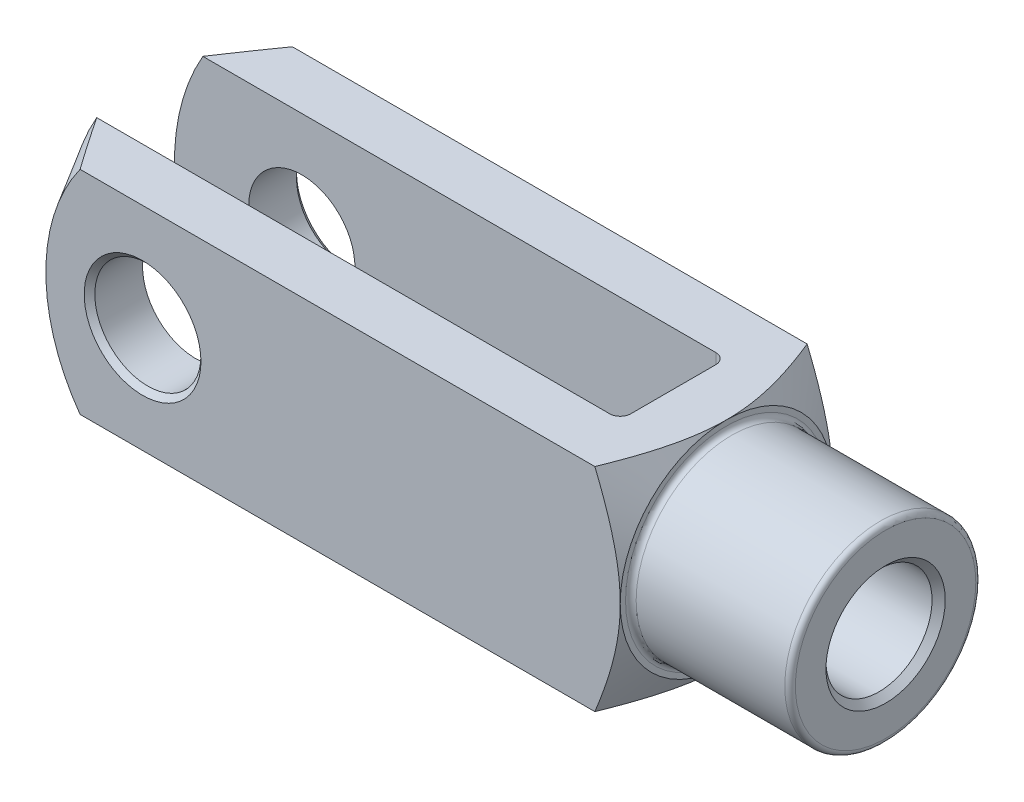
ISO-10303-21;
HEADER;
FILE_DESCRIPTION(('STEP AP214'),'2;1');
FILE_NAME('part.step','',(''),(''),'','','');
FILE_SCHEMA(('AUTOMOTIVE_DESIGN { 1 0 10303 214 1 1 1 1 }'));
ENDSEC;
DATA;
#1=APPLICATION_CONTEXT('core data for automotive mechanical design processes');
#2=APPLICATION_PROTOCOL_DEFINITION('international standard','automotive_design',2000,#1);
#3=PRODUCT_CONTEXT('',#1,'mechanical');
#4=PRODUCT('Part','Part','',(#3));
#5=PRODUCT_RELATED_PRODUCT_CATEGORY('part','',(#4));
#6=PRODUCT_DEFINITION_FORMATION('','',#4);
#7=PRODUCT_DEFINITION_CONTEXT('part definition',#1,'design');
#8=PRODUCT_DEFINITION('design','',#6,#7);
#9=PRODUCT_DEFINITION_SHAPE('','',#8);
#10=(LENGTH_UNIT() NAMED_UNIT(*) SI_UNIT(.MILLI.,.METRE.));
#11=(NAMED_UNIT(*) PLANE_ANGLE_UNIT() SI_UNIT($,.RADIAN.));
#12=(NAMED_UNIT(*) SI_UNIT($,.STERADIAN.) SOLID_ANGLE_UNIT());
#13=UNCERTAINTY_MEASURE_WITH_UNIT(LENGTH_MEASURE(1.E-05),#10,'distance_accuracy_value','');
#14=(GEOMETRIC_REPRESENTATION_CONTEXT(3) GLOBAL_UNCERTAINTY_ASSIGNED_CONTEXT((#13)) GLOBAL_UNIT_ASSIGNED_CONTEXT((#10,
#11,#12)) REPRESENTATION_CONTEXT('',''));
#15=CARTESIAN_POINT('',(0.,0.,0.));
#16=DIRECTION('',(0.,0.,1.));
#17=DIRECTION('',(1.,0.,0.));
#18=AXIS2_PLACEMENT_3D('',#15,#16,#17);
#19=CARTESIAN_POINT('',(-21.,-10.,-3.99999999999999));
#20=DIRECTION('',(0.,-1.,0.));
#21=DIRECTION('',(0.,0.,-1.));
#22=AXIS2_PLACEMENT_3D('',#19,#20,#21);
#23=CYLINDRICAL_SURFACE('',#22,1.);
#24=DIRECTION('',(0.,1.,0.));
#25=VECTOR('',#24,1.);
#26=CARTESIAN_POINT('',(-20.,-10.,-3.99999999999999));
#27=LINE('',#26,#25);
#28=CARTESIAN_POINT('',(-20.,-3.00000000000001,-3.99999999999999));
#29=VERTEX_POINT('',#28);
#30=CARTESIAN_POINT('',(-20.,-10.,-3.99999999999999));
#31=VERTEX_POINT('',#30);
#32=EDGE_CURVE('E359',#29,#31,#27,.F.);
#33=ORIENTED_EDGE('',*,*,#32,.F.);
#34=CARTESIAN_POINT('',(-20.,-3.00000000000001,-3.99999999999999));
#35=CARTESIAN_POINT('',(-20.0000371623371,-2.93694469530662,-4.04730456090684));
#36=CARTESIAN_POINT('',(-20.0033524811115,-2.87282528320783,-4.09305159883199));
#37=CARTESIAN_POINT('',(-20.0155357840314,-2.74298227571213,-4.18116773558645));
#38=CARTESIAN_POINT('',(-20.0243931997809,-2.67726196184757,-4.22354309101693));
#39=CARTESIAN_POINT('',(-20.0465893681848,-2.54494770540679,-4.30455906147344));
#40=CARTESIAN_POINT('',(-20.0598973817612,-2.47836268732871,-4.34322301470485));
#41=CARTESIAN_POINT('',(-20.0902730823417,-2.34411430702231,-4.41712604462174));
#42=CARTESIAN_POINT('',(-20.1073432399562,-2.27645026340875,-4.45236284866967));
#43=CARTESIAN_POINT('',(-20.1564689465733,-2.09692992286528,-4.54073885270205));
#44=CARTESIAN_POINT('',(-20.1911463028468,-1.98436263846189,-4.59099447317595));
#45=CARTESIAN_POINT('',(-20.2666906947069,-1.75765553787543,-4.68247844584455));
#46=CARTESIAN_POINT('',(-20.3075603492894,-1.64351507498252,-4.72370296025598));
#47=CARTESIAN_POINT('',(-20.3940114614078,-1.4136948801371,-4.79750849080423));
#48=CARTESIAN_POINT('',(-20.4396106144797,-1.29801088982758,-4.8300552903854));
#49=CARTESIAN_POINT('',(-20.5340479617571,-1.06592793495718,-4.88651783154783));
#50=CARTESIAN_POINT('',(-20.5828851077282,-0.949529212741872,-4.91043635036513));
#51=CARTESIAN_POINT('',(-20.6911535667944,-0.696523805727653,-4.95317913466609));
#52=CARTESIAN_POINT('',(-20.7509805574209,-0.559826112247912,-4.9704595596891));
#53=CARTESIAN_POINT('',(-20.8719499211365,-0.286372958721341,-4.99367348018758));
#54=CARTESIAN_POINT('',(-20.9330893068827,-0.149618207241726,-4.9996304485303));
#55=CARTESIAN_POINT('',(-20.9961510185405,-0.00860658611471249,-4.99999444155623));
#56=CARTESIAN_POINT('',(-20.9980755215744,-0.00430326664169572,-4.99999999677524));
#57=CARTESIAN_POINT('',(-21.,0.,-5.));
#58=B_SPLINE_CURVE_WITH_KNOTS('',3,(#34,#35,#36,#37,#38,#39,#40,#41,#42,#43,#44,#45,#46,#47,#48,
#49,#50,#51,#52,#53,#54,#55,#56,#57),.UNSPECIFIED.,.F.,.F.,(4,2,2,2,2,2,2,2,2,2,2,4),(0.,
0.236272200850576,0.472095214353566,0.706321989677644,0.940703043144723,1.3242927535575,
1.70804515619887,2.09328905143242,2.47840883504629,2.92860728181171,3.37787147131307,
3.39201361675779),.UNSPECIFIED.);
#59=CARTESIAN_POINT('',(-21.,0.,-5.));
#60=VERTEX_POINT('',#59);
#61=EDGE_CURVE('E390',#29,#60,#58,.T.);
#62=ORIENTED_EDGE('',*,*,#61,.T.);
#63=DIRECTION('',(0.,1.,0.));
#64=VECTOR('',#63,1.);
#65=CARTESIAN_POINT('',(-21.,10.,-4.99999999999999));
#66=LINE('',#65,#64);
#67=CARTESIAN_POINT('',(-21.,-10.,-4.99999999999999));
#68=VERTEX_POINT('',#67);
#69=EDGE_CURVE('E183',#68,#60,#66,.T.);
#70=ORIENTED_EDGE('',*,*,#69,.F.);
#71=CARTESIAN_POINT('',(-21.,-10.,-3.99999999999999));
#72=DIRECTION('',(0.,-1.,0.));
#73=DIRECTION('',(0.,0.,-1.));
#74=AXIS2_PLACEMENT_3D('',#71,#72,#73);
#75=CIRCLE('',#74,1.);
#76=EDGE_CURVE('E198',#31,#68,#75,.F.);
#77=ORIENTED_EDGE('',*,*,#76,.F.);
#78=EDGE_LOOP('',(#33,#62,#70,#77));
#79=FACE_BOUND('',#78,.T.);
#80=ADVANCED_FACE('F37',(#79),#23,.F.);
#81=CARTESIAN_POINT('',(-20.,-10.,-4.99999999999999));
#82=DIRECTION('',(1.,0.,0.));
#83=DIRECTION('',(0.,0.,-1.));
#84=AXIS2_PLACEMENT_3D('',#81,#82,#83);
#85=PLANE('',#84);
#86=CARTESIAN_POINT('',(-20.,10.,-3.99999999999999));
#87=VERTEX_POINT('',#86);
#88=CARTESIAN_POINT('',(-20.,3.00000000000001,-3.99999999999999));
#89=VERTEX_POINT('',#88);
#90=EDGE_CURVE('E374',#87,#89,#27,.F.);
#91=ORIENTED_EDGE('',*,*,#90,.T.);
#92=CARTESIAN_POINT('',(-20.,0.,0.));
#93=DIRECTION('',(1.,0.,0.));
#94=DIRECTION('',(0.,0.,-1.));
#95=AXIS2_PLACEMENT_3D('',#92,#93,#94);
#96=CIRCLE('',#95,5.);
#97=CARTESIAN_POINT('',(-20.,3.,4.));
#98=VERTEX_POINT('',#97);
#99=EDGE_CURVE('E420',#89,#98,#96,.T.);
#100=ORIENTED_EDGE('',*,*,#99,.T.);
#101=DIRECTION('',(0.,1.,0.));
#102=VECTOR('',#101,1.);
#103=CARTESIAN_POINT('',(-20.,10.,4.));
#104=LINE('',#103,#102);
#105=CARTESIAN_POINT('',(-20.,10.,4.));
#106=VERTEX_POINT('',#105);
#107=EDGE_CURVE('E160',#98,#106,#104,.T.);
#108=ORIENTED_EDGE('',*,*,#107,.T.);
#109=DIRECTION('',(0.,0.,-1.));
#110=VECTOR('',#109,1.);
#111=CARTESIAN_POINT('',(-20.,10.,-4.99999999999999));
#112=LINE('',#111,#110);
#113=EDGE_CURVE('E339',#106,#87,#112,.T.);
#114=ORIENTED_EDGE('',*,*,#113,.T.);
#115=EDGE_LOOP('',(#91,#100,#108,#114));
#116=FACE_BOUND('',#115,.T.);
#117=ADVANCED_FACE('F485',(#116),#85,.F.);
#118=CARTESIAN_POINT('',(-21.,-10.,4.));
#119=DIRECTION('',(0.,-1.,0.));
#120=DIRECTION('',(0.,0.,-1.));
#121=AXIS2_PLACEMENT_3D('',#118,#119,#120);
#122=CYLINDRICAL_SURFACE('',#121,1.);
#123=ORIENTED_EDGE('',*,*,#107,.F.);
#124=CARTESIAN_POINT('',(-20.,3.,4.));
#125=CARTESIAN_POINT('',(-20.0000371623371,2.93694469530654,4.04730456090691));
#126=CARTESIAN_POINT('',(-20.0033524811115,2.87282528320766,4.09305159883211));
#127=CARTESIAN_POINT('',(-20.0155357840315,2.74298227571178,4.18116773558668));
#128=CARTESIAN_POINT('',(-20.0243931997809,2.67726196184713,4.22354309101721));
#129=CARTESIAN_POINT('',(-20.0465893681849,2.54494770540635,4.30455906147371));
#130=CARTESIAN_POINT('',(-20.0598973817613,2.47836268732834,4.34322301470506));
#131=CARTESIAN_POINT('',(-20.0902730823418,2.34411430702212,4.41712604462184));
#132=CARTESIAN_POINT('',(-20.1073432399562,2.27645026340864,4.45236284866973));
#133=CARTESIAN_POINT('',(-20.1564689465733,2.09692992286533,4.54073885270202));
#134=CARTESIAN_POINT('',(-20.1911463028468,1.984362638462,4.5909944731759));
#135=CARTESIAN_POINT('',(-20.2666906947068,1.75765553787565,4.68247844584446));
#136=CARTESIAN_POINT('',(-20.3075603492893,1.64351507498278,4.72370296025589));
#137=CARTESIAN_POINT('',(-20.3940114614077,1.41369488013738,4.79750849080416));
#138=CARTESIAN_POINT('',(-20.4396106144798,1.29801088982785,4.83005529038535));
#139=CARTESIAN_POINT('',(-20.5340479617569,1.06592793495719,4.88651783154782));
#140=CARTESIAN_POINT('',(-20.5828851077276,0.949529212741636,4.91043635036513));
#141=CARTESIAN_POINT('',(-20.6911535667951,0.696523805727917,4.95317913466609));
#142=CARTESIAN_POINT('',(-20.7509805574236,0.559826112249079,4.97045955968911));
#143=CARTESIAN_POINT('',(-20.8719499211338,0.286372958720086,4.99367348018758));
#144=CARTESIAN_POINT('',(-20.9330893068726,0.149618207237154,4.99963044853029));
#145=CARTESIAN_POINT('',(-20.9961510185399,0.00860658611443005,4.99999444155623));
#146=CARTESIAN_POINT('',(-20.9980755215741,0.00430326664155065,4.99999999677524));
#147=CARTESIAN_POINT('',(-21.,0.,5.));
#148=B_SPLINE_CURVE_WITH_KNOTS('',3,(#124,#125,#126,#127,#128,#129,#130,#131,#132,#133,#134,
#135,#136,#137,#138,#139,#140,#141,#142,#143,#144,#145,#146,#147),.UNSPECIFIED.,.F.,.F.,(4,2,2,
2,2,2,2,2,2,2,2,4),(0.,0.236272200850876,0.472095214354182,0.70632198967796,0.940703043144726,
1.3242927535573,1.70804515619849,2.09328905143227,2.47840883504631,2.92860728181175,
3.37787147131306,3.39201361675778),.UNSPECIFIED.);
#149=CARTESIAN_POINT('',(-21.,0.,5.));
#150=VERTEX_POINT('',#149);
#151=EDGE_CURVE('E145',#98,#150,#148,.T.);
#152=ORIENTED_EDGE('',*,*,#151,.T.);
#153=DIRECTION('',(0.,1.,0.));
#154=VECTOR('',#153,1.);
#155=CARTESIAN_POINT('',(-21.,-10.,5.));
#156=LINE('',#155,#154);
#157=CARTESIAN_POINT('',(-21.,10.,5.));
#158=VERTEX_POINT('',#157);
#159=EDGE_CURVE('E159',#158,#150,#156,.F.);
#160=ORIENTED_EDGE('',*,*,#159,.F.);
#161=CARTESIAN_POINT('',(-21.,10.,4.));
#162=DIRECTION('',(0.,1.,0.));
#163=DIRECTION('',(0.,0.,1.));
#164=AXIS2_PLACEMENT_3D('',#161,#162,#163);
#165=CIRCLE('',#164,1.);
#166=EDGE_CURVE('E190',#106,#158,#165,.F.);
#167=ORIENTED_EDGE('',*,*,#166,.F.);
#168=EDGE_LOOP('',(#123,#152,#160,#167));
#169=FACE_BOUND('',#168,.T.);
#170=ADVANCED_FACE('F156',(#169),#122,.F.);
#171=CARTESIAN_POINT('',(-72.,-10.,-4.99999999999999));
#172=DIRECTION('',(0.,0.,-1.));
#173=DIRECTION('',(-1.,0.,0.));
#174=AXIS2_PLACEMENT_3D('',#171,#172,#173);
#175=PLANE('',#174);
#176=CARTESIAN_POINT('',(-60.,0.,-4.99999999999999));
#177=DIRECTION('',(0.,0.,-1.));
#178=DIRECTION('',(-1.,0.,0.));
#179=AXIS2_PLACEMENT_3D('',#176,#177,#178);
#180=CIRCLE('',#179,5.);
#181=CARTESIAN_POINT('',(-65.,0.,-4.99999999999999));
#182=VERTEX_POINT('',#181);
#183=EDGE_CURVE('E369',#182,#182,#180,.F.);
#184=ORIENTED_EDGE('',*,*,#183,.F.);
#185=EDGE_LOOP('',(#184));
#186=FACE_BOUND('',#185,.T.);
#187=CARTESIAN_POINT('',(-52.,0.,-4.99999999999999));
#188=DIRECTION('',(0.,0.,1.));
#189=DIRECTION('',(1.,0.,0.));
#190=AXIS2_PLACEMENT_3D('',#187,#188,#189);
#191=CIRCLE('',#190,20.);
#192=CARTESIAN_POINT('',(-69.3205080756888,10.,-4.99999999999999));
#193=VERTEX_POINT('',#192);
#194=CARTESIAN_POINT('',(-69.3205080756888,-10.,-4.99999999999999));
#195=VERTEX_POINT('',#194);
#196=EDGE_CURVE('E277',#193,#195,#191,.T.);
#197=ORIENTED_EDGE('',*,*,#196,.T.);
#198=DIRECTION('',(-1.,0.,0.));
#199=VECTOR('',#198,1.);
#200=CARTESIAN_POINT('',(-72.,-10.,-4.99999999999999));
#201=LINE('',#200,#199);
#202=EDGE_CURVE('E334',#68,#195,#201,.T.);
#203=ORIENTED_EDGE('',*,*,#202,.F.);
#204=ORIENTED_EDGE('',*,*,#69,.T.);
#205=CARTESIAN_POINT('',(-21.,10.,-4.99999999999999));
#206=VERTEX_POINT('',#205);
#207=EDGE_CURVE('E179',#60,#206,#66,.T.);
#208=ORIENTED_EDGE('',*,*,#207,.T.);
#209=DIRECTION('',(-1.,0.,0.));
#210=VECTOR('',#209,1.);
#211=CARTESIAN_POINT('',(-72.,10.,-4.99999999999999));
#212=LINE('',#211,#210);
#213=EDGE_CURVE('E347',#206,#193,#212,.T.);
#214=ORIENTED_EDGE('',*,*,#213,.T.);
#215=EDGE_LOOP('',(#197,#203,#204,#208,#214));
#216=FACE_BOUND('',#215,.T.);
#217=ADVANCED_FACE('F393',(#186,#216),#175,.F.);
#218=CARTESIAN_POINT('',(-72.,-10.,5.00000000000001));
#219=DIRECTION('',(0.,0.,1.));
#220=DIRECTION('',(1.,0.,0.));
#221=AXIS2_PLACEMENT_3D('',#218,#219,#220);
#222=PLANE('',#221);
#223=CARTESIAN_POINT('',(-60.,0.,5.));
#224=DIRECTION('',(0.,0.,1.));
#225=DIRECTION('',(1.,0.,0.));
#226=AXIS2_PLACEMENT_3D('',#223,#224,#225);
#227=CIRCLE('',#226,5.);
#228=CARTESIAN_POINT('',(-55.,0.,5.));
#229=VERTEX_POINT('',#228);
#230=EDGE_CURVE('E346',#229,#229,#227,.F.);
#231=ORIENTED_EDGE('',*,*,#230,.F.);
#232=EDGE_LOOP('',(#231));
#233=FACE_BOUND('',#232,.T.);
#234=DIRECTION('',(1.,0.,0.));
#235=VECTOR('',#234,1.);
#236=CARTESIAN_POINT('',(-72.,-10.,5.00000000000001));
#237=LINE('',#236,#235);
#238=CARTESIAN_POINT('',(-69.3205080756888,-10.,5.00000000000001));
#239=VERTEX_POINT('',#238);
#240=CARTESIAN_POINT('',(-21.,-10.,5.));
#241=VERTEX_POINT('',#240);
#242=EDGE_CURVE('E338',#239,#241,#237,.T.);
#243=ORIENTED_EDGE('',*,*,#242,.F.);
#244=CARTESIAN_POINT('',(-52.,0.,5.00000000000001));
#245=DIRECTION('',(0.,0.,1.));
#246=DIRECTION('',(1.,0.,0.));
#247=AXIS2_PLACEMENT_3D('',#244,#245,#246);
#248=CIRCLE('',#247,20.);
#249=CARTESIAN_POINT('',(-69.3205080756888,10.,5.00000000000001));
#250=VERTEX_POINT('',#249);
#251=EDGE_CURVE('E414',#250,#239,#248,.T.);
#252=ORIENTED_EDGE('',*,*,#251,.F.);
#253=DIRECTION('',(1.,0.,0.));
#254=VECTOR('',#253,1.);
#255=CARTESIAN_POINT('',(-72.,10.,5.00000000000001));
#256=LINE('',#255,#254);
#257=EDGE_CURVE('E176',#250,#158,#256,.T.);
#258=ORIENTED_EDGE('',*,*,#257,.T.);
#259=ORIENTED_EDGE('',*,*,#159,.T.);
#260=EDGE_CURVE('E164',#150,#241,#156,.F.);
#261=ORIENTED_EDGE('',*,*,#260,.T.);
#262=EDGE_LOOP('',(#243,#252,#258,#259,#261));
#263=FACE_BOUND('',#262,.T.);
#264=ADVANCED_FACE('F173',(#233,#263),#222,.F.);
#265=CARTESIAN_POINT('',(-72.,-10.,10.));
#266=DIRECTION('',(0.,0.,1.));
#267=DIRECTION('',(1.,0.,0.));
#268=AXIS2_PLACEMENT_3D('',#265,#266,#267);
#269=PLANE('',#268);
#270=CARTESIAN_POINT('',(-60.,0.,10.));
#271=DIRECTION('',(0.,0.,1.));
#272=DIRECTION('',(1.,0.,0.));
#273=AXIS2_PLACEMENT_3D('',#270,#271,#272);
#274=CIRCLE('',#273,5.50000000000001);
#275=CARTESIAN_POINT('',(-54.5,0.,10.));
#276=VERTEX_POINT('',#275);
#277=EDGE_CURVE('E229',#276,#276,#274,.F.);
#278=ORIENTED_EDGE('',*,*,#277,.T.);
#279=EDGE_LOOP('',(#278));
#280=FACE_BOUND('',#279,.T.);
#281=DIRECTION('',(1.,0.,0.));
#282=VECTOR('',#281,1.);
#283=CARTESIAN_POINT('',(-72.,10.,10.));
#284=LINE('',#283,#282);
#285=CARTESIAN_POINT('',(-65.8875224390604,10.,10.));
#286=VERTEX_POINT('',#285);
#287=CARTESIAN_POINT('',(-17.391463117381,10.,10.));
#288=VERTEX_POINT('',#287);
#289=EDGE_CURVE('E366',#286,#288,#284,.T.);
#290=ORIENTED_EDGE('',*,*,#289,.F.);
#291=CARTESIAN_POINT('',(-52.,0.,10.));
#292=DIRECTION('',(0.,0.,1.));
#293=DIRECTION('',(1.,0.,0.));
#294=AXIS2_PLACEMENT_3D('',#291,#292,#293);
#295=CIRCLE('',#294,17.1132486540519);
#296=CARTESIAN_POINT('',(-65.8875224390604,-10.,10.));
#297=VERTEX_POINT('',#296);
#298=EDGE_CURVE('E61',#286,#297,#295,.T.);
#299=ORIENTED_EDGE('',*,*,#298,.T.);
#300=DIRECTION('',(1.,0.,0.));
#301=VECTOR('',#300,1.);
#302=CARTESIAN_POINT('',(-72.,-10.,10.));
#303=LINE('',#302,#301);
#304=CARTESIAN_POINT('',(-17.391463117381,-10.,10.));
#305=VERTEX_POINT('',#304);
#306=EDGE_CURVE('E363',#297,#305,#303,.T.);
#307=ORIENTED_EDGE('',*,*,#306,.T.);
#308=CARTESIAN_POINT('',(-22.3558734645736,-20.4240435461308,10.));
#309=CARTESIAN_POINT('',(-22.1003465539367,-19.9311836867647,10.));
#310=CARTESIAN_POINT('',(-21.8461705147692,-19.4376169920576,10.));
#311=CARTESIAN_POINT('',(-21.3412365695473,-18.4487061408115,10.));
#312=CARTESIAN_POINT('',(-21.0904788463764,-17.9533618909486,10.));
#313=CARTESIAN_POINT('',(-20.5926922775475,-16.9597202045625,10.));
#314=CARTESIAN_POINT('',(-20.3456706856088,-16.4614191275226,10.));
#315=CARTESIAN_POINT('',(-19.8568264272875,-15.4622801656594,10.));
#316=CARTESIAN_POINT('',(-19.6150036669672,-14.9614423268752,10.));
#317=CARTESIAN_POINT('',(-19.1232043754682,-13.9257515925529,10.));
#318=CARTESIAN_POINT('',(-18.8736415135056,-13.3907016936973,10.));
#319=CARTESIAN_POINT('',(-18.3840144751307,-12.3162208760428,10.));
#320=CARTESIAN_POINT('',(-18.1439507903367,-11.7767897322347,10.));
#321=CARTESIAN_POINT('',(-17.6764473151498,-10.6927476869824,10.));
#322=CARTESIAN_POINT('',(-17.4490019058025,-10.1481392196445,10.));
#323=CARTESIAN_POINT('',(-17.0108100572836,-9.05224110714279,10.));
#324=CARTESIAN_POINT('',(-16.8000616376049,-8.50095226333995,10.));
#325=CARTESIAN_POINT('',(-16.4792530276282,-7.60769970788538,10.));
#326=CARTESIAN_POINT('',(-16.3620787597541,-7.26829451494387,10.));
#327=CARTESIAN_POINT('',(-16.1378183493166,-6.58617800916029,10.));
#328=CARTESIAN_POINT('',(-16.0307313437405,-6.24346698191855,10.));
#329=CARTESIAN_POINT('',(-15.828626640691,-5.55448777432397,10.));
#330=CARTESIAN_POINT('',(-15.733608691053,-5.2082196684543,10.));
#331=CARTESIAN_POINT('',(-15.5579131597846,-4.51203468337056,10.));
#332=CARTESIAN_POINT('',(-15.4772354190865,-4.16211784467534,10.));
#333=CARTESIAN_POINT('',(-15.3343492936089,-3.46705706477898,10.));
#334=CARTESIAN_POINT('',(-15.2717518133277,-3.12199390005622,10.));
#335=CARTESIAN_POINT('',(-15.1647579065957,-2.42903327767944,10.));
#336=CARTESIAN_POINT('',(-15.1203608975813,-2.08113591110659,10.));
#337=CARTESIAN_POINT('',(-15.0516237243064,-1.38356903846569,10.));
#338=CARTESIAN_POINT('',(-15.0272704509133,-1.03390084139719,10.));
#339=CARTESIAN_POINT('',(-14.9996951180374,-0.333728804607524,10.));
#340=CARTESIAN_POINT('',(-14.9964723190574,0.0167750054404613,10.));
#341=CARTESIAN_POINT('',(-15.010762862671,0.691790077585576,10.));
#342=CARTESIAN_POINT('',(-15.0267823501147,1.01633432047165,10.));
#343=CARTESIAN_POINT('',(-15.0764553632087,1.66405607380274,10.));
#344=CARTESIAN_POINT('',(-15.1101088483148,1.98723358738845,10.));
#345=CARTESIAN_POINT('',(-15.1938161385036,2.63160306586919,10.));
#346=CARTESIAN_POINT('',(-15.2438784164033,2.95279391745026,10.));
#347=CARTESIAN_POINT('',(-15.3587527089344,3.59250988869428,10.));
#348=CARTESIAN_POINT('',(-15.4235651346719,3.91103493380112,10.));
#349=CARTESIAN_POINT('',(-15.5682001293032,4.55432870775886,10.));
#350=CARTESIAN_POINT('',(-15.6484028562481,4.87901130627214,10.));
#351=CARTESIAN_POINT('',(-15.8205817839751,5.52521807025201,10.));
#352=CARTESIAN_POINT('',(-15.9125580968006,5.84674220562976,10.));
#353=CARTESIAN_POINT('',(-16.1065044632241,6.48673250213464,10.));
#354=CARTESIAN_POINT('',(-16.2084740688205,6.80519879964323,10.));
#355=CARTESIAN_POINT('',(-16.3677555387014,7.28075232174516,10.));
#356=CARTESIAN_POINT('',(-16.4219029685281,7.43891003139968,10.));
#357=CARTESIAN_POINT('',(-16.5321392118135,7.75454715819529,10.));
#358=CARTESIAN_POINT('',(-16.5882280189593,7.91202657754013,10.));
#359=CARTESIAN_POINT('',(-16.7684482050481,8.40910944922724,10.));
#360=CARTESIAN_POINT('',(-16.8958517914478,8.74752927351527,10.));
#361=CARTESIAN_POINT('',(-17.1575763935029,9.42169147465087,10.));
#362=CARTESIAN_POINT('',(-17.2918978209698,9.75743369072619,10.));
#363=CARTESIAN_POINT('',(-17.5663381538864,10.4266152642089,10.));
#364=CARTESIAN_POINT('',(-17.7064582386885,10.7600541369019,10.));
#365=CARTESIAN_POINT('',(-17.9915396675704,11.4248600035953,10.));
#366=CARTESIAN_POINT('',(-18.1365011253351,11.7562269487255,10.));
#367=CARTESIAN_POINT('',(-18.4306248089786,12.4174211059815,10.));
#368=CARTESIAN_POINT('',(-18.579790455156,12.7472467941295,10.));
#369=CARTESIAN_POINT('',(-18.8815899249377,13.4053092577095,10.));
#370=CARTESIAN_POINT('',(-19.0342237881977,13.7335460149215,10.));
#371=CARTESIAN_POINT('',(-19.496500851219,14.7160981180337,10.));
#372=CARTESIAN_POINT('',(-19.8105565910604,15.3683378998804,10.));
#373=CARTESIAN_POINT('',(-20.4483163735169,16.6705289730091,10.));
#374=CARTESIAN_POINT('',(-20.7720469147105,17.3204672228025,10.));
#375=CARTESIAN_POINT('',(-21.4261391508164,18.6170111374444,10.));
#376=CARTESIAN_POINT('',(-21.7565009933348,19.2636167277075,10.));
#377=CARTESIAN_POINT('',(-22.4221745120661,20.5538665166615,10.));
#378=CARTESIAN_POINT('',(-22.7574836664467,21.197512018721,10.));
#379=CARTESIAN_POINT('',(-23.4321254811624,22.4826820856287,10.));
#380=CARTESIAN_POINT('',(-23.7714581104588,23.1242066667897,10.));
#381=CARTESIAN_POINT('',(-24.6929935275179,24.8559334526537,10.));
#382=CARTESIAN_POINT('',(-25.2782369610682,25.9445168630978,10.));
#383=CARTESIAN_POINT('',(-26.4553238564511,28.1183008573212,10.));
#384=CARTESIAN_POINT('',(-27.0471682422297,29.2035009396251,10.));
#385=CARTESIAN_POINT('',(-28.232230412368,31.3650726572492,10.));
#386=CARTESIAN_POINT('',(-28.8254209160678,32.4414592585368,10.));
#387=CARTESIAN_POINT('',(-29.7178280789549,34.0544764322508,10.));
#388=CARTESIAN_POINT('',(-30.0157104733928,34.5918461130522,10.));
#389=CARTESIAN_POINT('',(-30.6122603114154,35.666148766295,10.));
#390=CARTESIAN_POINT('',(-30.9109277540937,36.2030817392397,10.));
#391=CARTESIAN_POINT('',(-31.2099360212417,36.7398248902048,10.));
#392=B_SPLINE_CURVE_WITH_KNOTS('',3,(#308,#309,#310,#311,#312,#313,#314,#315,#316,#317,#318,
#319,#320,#321,#322,#323,#324,#325,#326,#327,#328,#329,#330,#331,#332,#333,#334,#335,#336,#337,
#338,#339,#340,#341,#342,#343,#344,#345,#346,#347,#348,#349,#350,#351,#352,#353,#354,#355,#356,
#357,#358,#359,#360,#361,#362,#363,#364,#365,#366,#367,#368,#369,#370,#371,#372,#373,#374,#375,
#376,#377,#378,#379,#380,#381,#382,#383,#384,#385,#386,#387,#388,#389,#390,#391),.UNSPECIFIED.,
.F.,.F.,(4,2,2,2,2,2,2,2,2,2,2,2,2,2,2,2,2,2,2,2,2,2,2,2,2,2,2,2,2,2,2,2,2,2,2,2,2,2,2,2,2,4),
(0.,1.66549246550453,3.33107368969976,4.99955529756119,6.66800673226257,8.43910594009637,
10.2102966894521,11.980692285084,13.7508775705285,14.8279395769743,15.9049093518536,
16.9818566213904,18.0587919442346,19.1104471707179,20.162068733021,21.2130019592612,
22.2638984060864,23.2382198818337,24.2125391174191,25.1873622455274,26.1622125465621,
27.1652790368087,28.1683550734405,29.1713861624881,29.6728858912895,30.1743839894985,
31.2591028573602,32.3438863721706,33.4288916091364,34.5139223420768,35.59986283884,
36.685815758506,38.857450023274,41.0357057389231,43.2140099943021,45.3912398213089,
47.5684528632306,51.2762079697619,54.9844887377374,58.6715305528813,60.5147611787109,
62.3579896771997),.UNSPECIFIED.);
#393=CARTESIAN_POINT('',(-15.,0.,10.));
#394=VERTEX_POINT('',#393);
#395=EDGE_CURVE('E306',#394,#305,#392,.F.);
#396=ORIENTED_EDGE('',*,*,#395,.F.);
#397=EDGE_CURVE('E304',#288,#394,#392,.F.);
#398=ORIENTED_EDGE('',*,*,#397,.F.);
#399=EDGE_LOOP('',(#290,#299,#307,#396,#398));
#400=FACE_BOUND('',#399,.T.);
#401=ADVANCED_FACE('F288',(#280,#400),#269,.T.);
#402=CARTESIAN_POINT('',(-72.,-10.,10.));
#403=DIRECTION('',(0.,-1.,0.));
#404=DIRECTION('',(0.,0.,-1.));
#405=AXIS2_PLACEMENT_3D('',#402,#403,#404);
#406=PLANE('',#405);
#407=ORIENTED_EDGE('',*,*,#202,.T.);
#408=CARTESIAN_POINT('',(-77.2321898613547,-10.,7.36951687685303));
#409=CARTESIAN_POINT('',(-76.745633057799,-10.,6.58611648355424));
#410=CARTESIAN_POINT('',(-76.2577437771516,-10.,5.80353993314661));
#411=CARTESIAN_POINT('',(-75.2786767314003,-10.,4.24042523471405));
#412=CARTESIAN_POINT('',(-74.7874989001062,-10.,3.45988712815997));
#413=CARTESIAN_POINT('',(-73.8006621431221,-10.,1.90034138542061));
#414=CARTESIAN_POINT('',(-73.3049985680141,-10.,1.12133668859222));
#415=CARTESIAN_POINT('',(-72.3089364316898,-10.,-0.433632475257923));
#416=CARTESIAN_POINT('',(-71.8085379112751,-10.,-1.20959696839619));
#417=CARTESIAN_POINT('',(-70.780963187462,-10.,-2.78997730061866));
#418=CARTESIAN_POINT('',(-70.2535395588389,-10.,-3.59423250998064));
#419=CARTESIAN_POINT('',(-69.1907284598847,-10.,-5.19745714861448));
#420=CARTESIAN_POINT('',(-68.6553410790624,-10.,-5.9964266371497));
#421=CARTESIAN_POINT('',(-67.5747096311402,-10.,-7.58683469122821));
#422=CARTESIAN_POINT('',(-67.0294731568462,-10.,-8.37827839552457));
#423=CARTESIAN_POINT('',(-66.2014533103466,-10.,-9.55828753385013));
#424=CARTESIAN_POINT('',(-65.9237578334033,-10.,-9.9504238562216));
#425=CARTESIAN_POINT('',(-65.3644017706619,-10.,-10.7318561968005));
#426=CARTESIAN_POINT('',(-65.0827412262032,-10.,-11.1211522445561));
#427=CARTESIAN_POINT('',(-64.5174190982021,-10.,-11.8927308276));
#428=CARTESIAN_POINT('',(-64.2338006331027,-10.,-12.2750449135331));
#429=CARTESIAN_POINT('',(-63.6611630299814,-10.,-13.0356258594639));
#430=CARTESIAN_POINT('',(-63.3721437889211,-10.,-13.4138926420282));
#431=CARTESIAN_POINT('',(-62.787258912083,-10.,-14.1659406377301));
#432=CARTESIAN_POINT('',(-62.4913844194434,-10.,-14.5397149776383));
#433=CARTESIAN_POINT('',(-61.8918382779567,-10.,-15.2809455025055));
#434=CARTESIAN_POINT('',(-61.5881670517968,-10.,-15.6484020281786));
#435=CARTESIAN_POINT('',(-60.9744614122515,-10.,-16.3714518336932));
#436=CARTESIAN_POINT('',(-60.6645256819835,-10.,-16.7271286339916));
#437=CARTESIAN_POINT('',(-60.0329680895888,-10.,-17.4282054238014));
#438=CARTESIAN_POINT('',(-59.7113432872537,-10.,-17.7736027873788));
#439=CARTESIAN_POINT('',(-59.2183551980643,-10.,-18.2807263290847));
#440=CARTESIAN_POINT('',(-59.0524514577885,-10.,-18.4477649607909));
#441=CARTESIAN_POINT('',(-58.716558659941,-10.,-18.7776754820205));
#442=CARTESIAN_POINT('',(-58.5465698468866,-10.,-18.9405476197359));
#443=CARTESIAN_POINT('',(-58.2020749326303,-10.,-19.2612725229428));
#444=CARTESIAN_POINT('',(-58.0275712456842,-10.,-19.4191278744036));
#445=CARTESIAN_POINT('',(-57.6733935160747,-10.,-19.7289072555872));
#446=CARTESIAN_POINT('',(-57.4937200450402,-10.,-19.8808319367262));
#447=CARTESIAN_POINT('',(-57.1220498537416,-10.,-20.1827912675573));
#448=CARTESIAN_POINT('',(-56.9298420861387,-10.,-20.3325675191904));
#449=CARTESIAN_POINT('',(-56.538357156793,-10.,-20.6227066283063));
#450=CARTESIAN_POINT('',(-56.3390786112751,-10.,-20.7630676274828));
#451=CARTESIAN_POINT('',(-55.932846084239,-10.,-21.0319774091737));
#452=CARTESIAN_POINT('',(-55.7258982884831,-10.,-21.160535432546));
#453=CARTESIAN_POINT('',(-55.3037021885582,-10.,-21.4030294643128));
#454=CARTESIAN_POINT('',(-55.0884560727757,-10.,-21.5169692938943));
#455=CARTESIAN_POINT('',(-54.5296464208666,-10.,-21.7838098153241));
#456=CARTESIAN_POINT('',(-54.1798259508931,-10.,-21.9243079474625));
#457=CARTESIAN_POINT('',(-53.6418795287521,-10.,-22.0912640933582));
#458=CARTESIAN_POINT('',(-53.4604354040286,-10.,-22.1396072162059));
#459=CARTESIAN_POINT('',(-53.093915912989,-10.,-22.2200235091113));
#460=CARTESIAN_POINT('',(-52.908840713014,-10.,-22.2520974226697));
#461=CARTESIAN_POINT('',(-52.5346022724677,-10.,-22.2988166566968));
#462=CARTESIAN_POINT('',(-52.3454166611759,-10.,-22.313284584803));
#463=CARTESIAN_POINT('',(-51.9665401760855,-10.,-22.3235178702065));
#464=CARTESIAN_POINT('',(-51.7768493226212,-10.,-22.3192839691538));
#465=CARTESIAN_POINT('',(-51.3987646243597,-10.,-22.292316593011));
#466=CARTESIAN_POINT('',(-51.2103710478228,-10.,-22.2695794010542));
#467=CARTESIAN_POINT('',(-50.8365348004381,-10.,-22.2066526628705));
#468=CARTESIAN_POINT('',(-50.6510925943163,-10.,-22.1664603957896));
#469=CARTESIAN_POINT('',(-50.2504201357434,-10.,-22.0613497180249));
#470=CARTESIAN_POINT('',(-50.0360329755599,-10.,-21.9932307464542));
#471=CARTESIAN_POINT('',(-49.6142317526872,-10.,-21.8379822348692));
#472=CARTESIAN_POINT('',(-49.4068216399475,-10.,-21.750842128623));
#473=CARTESIAN_POINT('',(-48.9988371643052,-10.,-21.5605082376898));
#474=CARTESIAN_POINT('',(-48.7982845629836,-10.,-21.4572682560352));
#475=CARTESIAN_POINT('',(-48.4045157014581,-10.,-21.2378022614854));
#476=CARTESIAN_POINT('',(-48.2112986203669,-10.,-21.121577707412));
#477=CARTESIAN_POINT('',(-47.7694245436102,-10.,-20.83866105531));
#478=CARTESIAN_POINT('',(-47.5233696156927,-10.,-20.6679192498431));
#479=CARTESIAN_POINT('',(-47.0418236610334,-10.,-20.3120669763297));
#480=CARTESIAN_POINT('',(-46.8063377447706,-10.,-20.1269496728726));
#481=CARTESIAN_POINT('',(-46.3441491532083,-10.,-19.7452386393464));
#482=CARTESIAN_POINT('',(-46.1174642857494,-10.,-19.5486234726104));
#483=CARTESIAN_POINT('',(-45.6720928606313,-10.,-19.1466530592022));
#484=CARTESIAN_POINT('',(-45.4534049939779,-10.,-18.9412992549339));
#485=CARTESIAN_POINT('',(-45.0214181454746,-10.,-18.5221818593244));
#486=CARTESIAN_POINT('',(-44.8081650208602,-10.,-18.3083711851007));
#487=CARTESIAN_POINT('',(-44.3876033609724,-10.,-17.8749857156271));
#488=CARTESIAN_POINT('',(-44.1802950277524,-10.,-17.6554107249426));
#489=CARTESIAN_POINT('',(-43.7710307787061,-10.,-17.2117611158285));
#490=CARTESIAN_POINT('',(-43.5690695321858,-10.,-16.9876914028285));
#491=CARTESIAN_POINT('',(-43.1696072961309,-10.,-16.5356277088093));
#492=CARTESIAN_POINT('',(-42.9721062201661,-10.,-16.3076338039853));
#493=CARTESIAN_POINT('',(-42.4999897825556,-10.,-15.7532280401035));
#494=CARTESIAN_POINT('',(-42.2273152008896,-10.,-15.4251642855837));
#495=CARTESIAN_POINT('',(-41.6883836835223,-10.,-14.7637172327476));
#496=CARTESIAN_POINT('',(-41.4221280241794,-10.,-14.43033289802));
#497=CARTESIAN_POINT('',(-40.899094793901,-10.,-13.7644395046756));
#498=CARTESIAN_POINT('',(-40.6422345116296,-10.,-13.4319952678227));
#499=CARTESIAN_POINT('',(-40.1331161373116,-10.,-12.7637580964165));
#500=CARTESIAN_POINT('',(-39.8808566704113,-10.,-12.4279662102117));
#501=CARTESIAN_POINT('',(-39.6304831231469,-10.,-12.0907921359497));
#502=B_SPLINE_CURVE_WITH_KNOTS('',3,(#408,#409,#410,#411,#412,#413,#414,#415,#416,#417,#418,
#419,#420,#421,#422,#423,#424,#425,#426,#427,#428,#429,#430,#431,#432,#433,#434,#435,#436,#437,
#438,#439,#440,#441,#442,#443,#444,#445,#446,#447,#448,#449,#450,#451,#452,#453,#454,#455,#456,
#457,#458,#459,#460,#461,#462,#463,#464,#465,#466,#467,#468,#469,#470,#471,#472,#473,#474,#475,
#476,#477,#478,#479,#480,#481,#482,#483,#484,#485,#486,#487,#488,#489,#490,#491,#492,#493,#494,
#495,#496,#497,#498,#499,#500,#501),.UNSPECIFIED.,.F.,.F.,(4,2,2,2,2,2,2,2,2,2,2,2,2,2,2,2,2,2,
2,2,2,2,2,2,2,2,2,2,2,2,2,2,2,2,2,2,2,2,2,2,2,2,2,2,2,2,4),(0.,2.7666047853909,5.53326542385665,
8.30322881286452,11.0731683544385,13.9584410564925,16.8436813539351,19.7267850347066,
21.1682825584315,22.6097650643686,24.0378123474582,25.465886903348,26.8959225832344,
28.3258808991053,29.7410059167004,31.1564893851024,31.862713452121,32.5688953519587,
33.2747071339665,33.9804411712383,34.7112197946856,35.4421422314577,36.1724874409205,
36.9026413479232,38.0289522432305,38.5916651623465,39.1543523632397,39.7226632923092,
40.2909516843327,40.8593542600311,41.427845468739,42.1016117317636,42.7757532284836,
43.4518659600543,44.1279028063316,45.0256730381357,45.9238727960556,46.8238041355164,
47.7235875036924,48.6293923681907,49.5352279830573,50.4401236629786,51.3450017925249,
52.6246585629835,53.9045677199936,55.1648707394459,56.4247907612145),.UNSPECIFIED.);
#503=CARTESIAN_POINT('',(-65.8875224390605,-10.,-10.));
#504=VERTEX_POINT('',#503);
#505=EDGE_CURVE('E276',#195,#504,#502,.T.);
#506=ORIENTED_EDGE('',*,*,#505,.T.);
#507=DIRECTION('',(1.,0.,0.));
#508=VECTOR('',#507,1.);
#509=CARTESIAN_POINT('',(-72.,-10.,-10.));
#510=LINE('',#509,#508);
#511=CARTESIAN_POINT('',(-17.391463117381,-10.,-10.));
#512=VERTEX_POINT('',#511);
#513=EDGE_CURVE('E360',#504,#512,#510,.T.);
#514=ORIENTED_EDGE('',*,*,#513,.T.);
#515=CARTESIAN_POINT('',(-22.3558734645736,-10.,-20.4240435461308));
#516=CARTESIAN_POINT('',(-22.1003465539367,-10.,-19.9311836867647));
#517=CARTESIAN_POINT('',(-21.8461705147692,-10.,-19.4376169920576));
#518=CARTESIAN_POINT('',(-21.3412365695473,-10.,-18.4487061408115));
#519=CARTESIAN_POINT('',(-21.0904788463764,-10.,-17.9533618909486));
#520=CARTESIAN_POINT('',(-20.5926922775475,-10.,-16.9597202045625));
#521=CARTESIAN_POINT('',(-20.3456706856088,-10.,-16.4614191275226));
#522=CARTESIAN_POINT('',(-19.8568264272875,-10.,-15.4622801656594));
#523=CARTESIAN_POINT('',(-19.6150036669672,-10.,-14.9614423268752));
#524=CARTESIAN_POINT('',(-19.1232043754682,-10.,-13.9257515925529));
#525=CARTESIAN_POINT('',(-18.8736415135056,-10.,-13.3907016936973));
#526=CARTESIAN_POINT('',(-18.3840144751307,-10.,-12.3162208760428));
#527=CARTESIAN_POINT('',(-18.1439507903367,-10.,-11.7767897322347));
#528=CARTESIAN_POINT('',(-17.6764473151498,-10.,-10.6927476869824));
#529=CARTESIAN_POINT('',(-17.4490019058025,-10.,-10.1481392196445));
#530=CARTESIAN_POINT('',(-17.0108100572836,-10.,-9.05224110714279));
#531=CARTESIAN_POINT('',(-16.8000616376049,-10.,-8.50095226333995));
#532=CARTESIAN_POINT('',(-16.4792530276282,-10.,-7.60769970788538));
#533=CARTESIAN_POINT('',(-16.3620787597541,-10.,-7.26829451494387));
#534=CARTESIAN_POINT('',(-16.1378183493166,-10.,-6.58617800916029));
#535=CARTESIAN_POINT('',(-16.0307313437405,-10.,-6.24346698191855));
#536=CARTESIAN_POINT('',(-15.828626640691,-10.,-5.55448777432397));
#537=CARTESIAN_POINT('',(-15.733608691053,-10.,-5.2082196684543));
#538=CARTESIAN_POINT('',(-15.5579131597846,-10.,-4.51203468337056));
#539=CARTESIAN_POINT('',(-15.4772354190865,-10.,-4.16211784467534));
#540=CARTESIAN_POINT('',(-15.3343492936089,-10.,-3.46705706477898));
#541=CARTESIAN_POINT('',(-15.2717518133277,-10.,-3.12199390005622));
#542=CARTESIAN_POINT('',(-15.1647579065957,-10.,-2.42903327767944));
#543=CARTESIAN_POINT('',(-15.1203608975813,-10.,-2.08113591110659));
#544=CARTESIAN_POINT('',(-15.0516237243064,-10.,-1.38356903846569));
#545=CARTESIAN_POINT('',(-15.0272704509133,-10.,-1.03390084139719));
#546=CARTESIAN_POINT('',(-14.9996951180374,-10.,-0.333728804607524));
#547=CARTESIAN_POINT('',(-14.9964723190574,-10.,0.0167750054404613));
#548=CARTESIAN_POINT('',(-15.010762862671,-10.,0.691790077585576));
#549=CARTESIAN_POINT('',(-15.0267823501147,-10.,1.01633432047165));
#550=CARTESIAN_POINT('',(-15.0764553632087,-10.,1.66405607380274));
#551=CARTESIAN_POINT('',(-15.1101088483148,-10.,1.98723358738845));
#552=CARTESIAN_POINT('',(-15.1938161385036,-10.,2.63160306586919));
#553=CARTESIAN_POINT('',(-15.2438784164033,-10.,2.95279391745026));
#554=CARTESIAN_POINT('',(-15.3587527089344,-10.,3.59250988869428));
#555=CARTESIAN_POINT('',(-15.4235651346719,-10.,3.91103493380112));
#556=CARTESIAN_POINT('',(-15.5682001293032,-10.,4.55432870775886));
#557=CARTESIAN_POINT('',(-15.6484028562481,-10.,4.87901130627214));
#558=CARTESIAN_POINT('',(-15.8205817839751,-10.,5.52521807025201));
#559=CARTESIAN_POINT('',(-15.9125580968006,-10.,5.84674220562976));
#560=CARTESIAN_POINT('',(-16.1065044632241,-10.,6.48673250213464));
#561=CARTESIAN_POINT('',(-16.2084740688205,-10.,6.80519879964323));
#562=CARTESIAN_POINT('',(-16.3677555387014,-10.,7.28075232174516));
#563=CARTESIAN_POINT('',(-16.4219029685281,-10.,7.43891003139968));
#564=CARTESIAN_POINT('',(-16.5321392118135,-10.,7.75454715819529));
#565=CARTESIAN_POINT('',(-16.5882280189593,-10.,7.91202657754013));
#566=CARTESIAN_POINT('',(-16.7684482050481,-10.,8.40910944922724));
#567=CARTESIAN_POINT('',(-16.8958517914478,-10.,8.74752927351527));
#568=CARTESIAN_POINT('',(-17.1575763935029,-10.,9.42169147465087));
#569=CARTESIAN_POINT('',(-17.2918978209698,-10.,9.75743369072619));
#570=CARTESIAN_POINT('',(-17.5663381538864,-10.,10.4266152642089));
#571=CARTESIAN_POINT('',(-17.7064582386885,-10.,10.7600541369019));
#572=CARTESIAN_POINT('',(-17.9915396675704,-10.,11.4248600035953));
#573=CARTESIAN_POINT('',(-18.1365011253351,-10.,11.7562269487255));
#574=CARTESIAN_POINT('',(-18.4306248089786,-10.,12.4174211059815));
#575=CARTESIAN_POINT('',(-18.579790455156,-10.,12.7472467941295));
#576=CARTESIAN_POINT('',(-18.8815899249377,-10.,13.4053092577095));
#577=CARTESIAN_POINT('',(-19.0342237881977,-10.,13.7335460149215));
#578=CARTESIAN_POINT('',(-19.496500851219,-10.,14.7160981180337));
#579=CARTESIAN_POINT('',(-19.8105565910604,-10.,15.3683378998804));
#580=CARTESIAN_POINT('',(-20.4483163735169,-10.,16.6705289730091));
#581=CARTESIAN_POINT('',(-20.7720469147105,-10.,17.3204672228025));
#582=CARTESIAN_POINT('',(-21.4261391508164,-10.,18.6170111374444));
#583=CARTESIAN_POINT('',(-21.7565009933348,-10.,19.2636167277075));
#584=CARTESIAN_POINT('',(-22.4221745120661,-10.,20.5538665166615));
#585=CARTESIAN_POINT('',(-22.7574836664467,-10.,21.197512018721));
#586=CARTESIAN_POINT('',(-23.4321254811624,-10.,22.4826820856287));
#587=CARTESIAN_POINT('',(-23.7714581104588,-10.,23.1242066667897));
#588=CARTESIAN_POINT('',(-24.6929935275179,-10.,24.8559334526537));
#589=CARTESIAN_POINT('',(-25.2782369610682,-10.,25.9445168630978));
#590=CARTESIAN_POINT('',(-26.4553238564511,-10.,28.1183008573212));
#591=CARTESIAN_POINT('',(-27.0471682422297,-10.,29.2035009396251));
#592=CARTESIAN_POINT('',(-28.232230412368,-10.,31.3650726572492));
#593=CARTESIAN_POINT('',(-28.8254209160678,-10.,32.4414592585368));
#594=CARTESIAN_POINT('',(-29.7178280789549,-10.,34.0544764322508));
#595=CARTESIAN_POINT('',(-30.0157104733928,-10.,34.5918461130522));
#596=CARTESIAN_POINT('',(-30.6122603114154,-10.,35.666148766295));
#597=CARTESIAN_POINT('',(-30.9109277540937,-10.,36.2030817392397));
#598=CARTESIAN_POINT('',(-31.2099360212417,-10.,36.7398248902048));
#599=B_SPLINE_CURVE_WITH_KNOTS('',3,(#515,#516,#517,#518,#519,#520,#521,#522,#523,#524,#525,
#526,#527,#528,#529,#530,#531,#532,#533,#534,#535,#536,#537,#538,#539,#540,#541,#542,#543,#544,
#545,#546,#547,#548,#549,#550,#551,#552,#553,#554,#555,#556,#557,#558,#559,#560,#561,#562,#563,
#564,#565,#566,#567,#568,#569,#570,#571,#572,#573,#574,#575,#576,#577,#578,#579,#580,#581,#582,
#583,#584,#585,#586,#587,#588,#589,#590,#591,#592,#593,#594,#595,#596,#597,#598),.UNSPECIFIED.,
.F.,.F.,(4,2,2,2,2,2,2,2,2,2,2,2,2,2,2,2,2,2,2,2,2,2,2,2,2,2,2,2,2,2,2,2,2,2,2,2,2,2,2,2,2,4),
(0.,1.66549246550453,3.33107368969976,4.99955529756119,6.66800673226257,8.43910594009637,
10.2102966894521,11.980692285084,13.7508775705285,14.8279395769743,15.9049093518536,
16.9818566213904,18.0587919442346,19.1104471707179,20.162068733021,21.2130019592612,
22.2638984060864,23.2382198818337,24.2125391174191,25.1873622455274,26.1622125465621,
27.1652790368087,28.1683550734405,29.1713861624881,29.6728858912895,30.1743839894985,
31.2591028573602,32.3438863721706,33.4288916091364,34.5139223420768,35.59986283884,
36.685815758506,38.857450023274,41.0357057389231,43.2140099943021,45.3912398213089,
47.5684528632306,51.2762079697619,54.9844887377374,58.6715305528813,60.5147611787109,
62.3579896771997),.UNSPECIFIED.);
#600=CARTESIAN_POINT('',(-15.,-10.,0.));
#601=VERTEX_POINT('',#600);
#602=EDGE_CURVE('E305',#601,#512,#599,.F.);
#603=ORIENTED_EDGE('',*,*,#602,.F.);
#604=EDGE_CURVE('E296',#305,#601,#599,.F.);
#605=ORIENTED_EDGE('',*,*,#604,.F.);
#606=ORIENTED_EDGE('',*,*,#306,.F.);
#607=CARTESIAN_POINT('',(-39.6304831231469,-10.,12.0907921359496));
#608=CARTESIAN_POINT('',(-39.8338762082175,-10.,12.3647242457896));
#609=CARTESIAN_POINT('',(-40.0385262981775,-10.,12.6377302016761));
#610=CARTESIAN_POINT('',(-40.4507369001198,-10.,13.181565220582));
#611=CARTESIAN_POINT('',(-40.6582976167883,-10.,13.4523941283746));
#612=CARTESIAN_POINT('',(-41.0770682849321,-10.,13.9919897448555));
#613=CARTESIAN_POINT('',(-41.2882840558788,-10.,14.2607519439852));
#614=CARTESIAN_POINT('',(-41.7144777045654,-10.,14.7952707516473));
#615=CARTESIAN_POINT('',(-41.9294554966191,-10.,15.0610274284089));
#616=CARTESIAN_POINT('',(-42.3658843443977,-10.,15.5915807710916));
#617=CARTESIAN_POINT('',(-42.5873782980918,-10.,15.8563422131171));
#618=CARTESIAN_POINT('',(-43.0354910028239,-10.,16.3814896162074));
#619=CARTESIAN_POINT('',(-43.2621096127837,-10.,16.6418756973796));
#620=CARTESIAN_POINT('',(-43.7211922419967,-10.,17.1571482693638));
#621=CARTESIAN_POINT('',(-43.9536523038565,-10.,17.4120382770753));
#622=CARTESIAN_POINT('',(-44.4255997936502,-10.,17.9152070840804));
#623=CARTESIAN_POINT('',(-44.665086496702,-10.,18.163486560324));
#624=CARTESIAN_POINT('',(-45.1139682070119,-10.,18.6132180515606));
#625=CARTESIAN_POINT('',(-45.3221499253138,-10.,18.8158782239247));
#626=CARTESIAN_POINT('',(-45.7454021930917,-10.,19.2139465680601));
#627=CARTESIAN_POINT('',(-45.9604733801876,-10.,19.4093540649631));
#628=CARTESIAN_POINT('',(-46.3987029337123,-10.,19.7911821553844));
#629=CARTESIAN_POINT('',(-46.6218657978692,-10.,19.9775976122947));
#630=CARTESIAN_POINT('',(-47.0773953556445,-10.,20.3388644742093));
#631=CARTESIAN_POINT('',(-47.3097609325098,-10.,20.5137172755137));
#632=CARTESIAN_POINT('',(-47.7515604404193,-10.,20.8249743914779));
#633=CARTESIAN_POINT('',(-47.9596155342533,-10.,20.9633255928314));
#634=CARTESIAN_POINT('',(-48.3843394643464,-10.,21.2263210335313));
#635=CARTESIAN_POINT('',(-48.6010095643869,-10.,21.3509632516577));
#636=CARTESIAN_POINT('',(-49.0427392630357,-10.,21.5826745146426));
#637=CARTESIAN_POINT('',(-49.2677692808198,-10.,21.6897994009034));
#638=CARTESIAN_POINT('',(-49.7267727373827,-10.,21.8827967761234));
#639=CARTESIAN_POINT('',(-49.9607405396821,-10.,21.9686824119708));
#640=CARTESIAN_POINT('',(-50.3615778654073,-10.,22.0917690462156));
#641=CARTESIAN_POINT('',(-50.5263625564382,-10.,22.1357833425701));
#642=CARTESIAN_POINT('',(-50.8589152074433,-10.,22.2104461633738));
#643=CARTESIAN_POINT('',(-51.0266821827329,-10.,22.2410990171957));
#644=CARTESIAN_POINT('',(-51.3641457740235,-10.,22.2879722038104));
#645=CARTESIAN_POINT('',(-51.5338413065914,-10.,22.3042002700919));
#646=CARTESIAN_POINT('',(-51.8740129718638,-10.,22.3216361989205));
#647=CARTESIAN_POINT('',(-52.0444891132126,-10.,22.3228438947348));
#648=CARTESIAN_POINT('',(-52.3849548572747,-10.,22.3101874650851));
#649=CARTESIAN_POINT('',(-52.5549441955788,-10.,22.2963163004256));
#650=CARTESIAN_POINT('',(-52.8930850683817,-10.,22.254024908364));
#651=CARTESIAN_POINT('',(-53.0612365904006,-10.,22.2256045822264));
#652=CARTESIAN_POINT('',(-53.3947372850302,-10.,22.1552039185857));
#653=CARTESIAN_POINT('',(-53.5600850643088,-10.,22.1132170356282));
#654=CARTESIAN_POINT('',(-53.8871598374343,-10.,22.0169946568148));
#655=CARTESIAN_POINT('',(-54.0488863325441,-10.,21.9627574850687));
#656=CARTESIAN_POINT('',(-54.4585882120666,-10.,21.8097172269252));
#657=CARTESIAN_POINT('',(-54.7036369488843,-10.,21.7030534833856));
#658=CARTESIAN_POINT('',(-55.183328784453,-10.,21.4684665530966));
#659=CARTESIAN_POINT('',(-55.4179646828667,-10.,21.340528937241));
#660=CARTESIAN_POINT('',(-55.8781923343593,-10.,21.0673698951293));
#661=CARTESIAN_POINT('',(-56.1037425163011,-10.,20.9220789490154));
#662=CARTESIAN_POINT('',(-56.4351087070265,-10.,20.694253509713));
#663=CARTESIAN_POINT('',(-56.5443890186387,-10.,20.6166754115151));
#664=CARTESIAN_POINT('',(-56.760789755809,-10.,20.4585635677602));
#665=CARTESIAN_POINT('',(-56.867910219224,-10.,20.3780298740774));
#666=CARTESIAN_POINT('',(-57.1887234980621,-10.,20.1305689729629));
#667=CARTESIAN_POINT('',(-57.39928659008,-10.,19.9595758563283));
#668=CARTESIAN_POINT('',(-57.81317555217,-10.,19.6090088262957));
#669=CARTESIAN_POINT('',(-58.0164996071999,-10.,19.4294327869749));
#670=CARTESIAN_POINT('',(-58.4169939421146,-10.,19.0631978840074));
#671=CARTESIAN_POINT('',(-58.6141583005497,-10.,18.8765325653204));
#672=CARTESIAN_POINT('',(-59.0029346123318,-10.,18.4975570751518));
#673=CARTESIAN_POINT('',(-59.1945470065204,-10.,18.3052473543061));
#674=CARTESIAN_POINT('',(-59.57361034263,-10.,17.9152543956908));
#675=CARTESIAN_POINT('',(-59.7610441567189,-10.,17.7175545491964));
#676=CARTESIAN_POINT('',(-60.1316526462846,-10.,17.3181961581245));
#677=CARTESIAN_POINT('',(-60.3148271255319,-10.,17.116537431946));
#678=CARTESIAN_POINT('',(-60.8585638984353,-10.,16.5067806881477));
#679=CARTESIAN_POINT('',(-61.2135375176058,-10.,16.0936958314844));
#680=CARTESIAN_POINT('',(-61.916118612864,-10.,15.252637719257));
#681=CARTESIAN_POINT('',(-62.263579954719,-10.,14.8245433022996));
#682=CARTESIAN_POINT('',(-62.9489926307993,-10.,13.9607593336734));
#683=CARTESIAN_POINT('',(-63.2869430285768,-10.,13.5250690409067));
#684=CARTESIAN_POINT('',(-63.9543933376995,-10.,12.6487798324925));
#685=CARTESIAN_POINT('',(-64.283910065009,-10.,12.208193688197));
#686=CARTESIAN_POINT('',(-64.9366302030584,-10.,11.3223637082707));
#687=CARTESIAN_POINT('',(-65.2598334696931,-10.,10.8771197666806));
#688=CARTESIAN_POINT('',(-66.1076555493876,-10.,9.69467023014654));
#689=CARTESIAN_POINT('',(-66.6278136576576,-10.,8.95426810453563));
#690=CARTESIAN_POINT('',(-67.6574557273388,-10.,7.46606978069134));
#691=CARTESIAN_POINT('',(-68.1669393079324,-10.,6.71827332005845));
#692=CARTESIAN_POINT('',(-69.1780504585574,-10.,5.21641287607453));
#693=CARTESIAN_POINT('',(-69.6796705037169,-10.,4.46234383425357));
#694=CARTESIAN_POINT('',(-70.6763124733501,-10.,2.94985825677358));
#695=CARTESIAN_POINT('',(-71.1713343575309,-10.,2.19144169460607));
#696=CARTESIAN_POINT('',(-72.1357984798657,-10.,0.702425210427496));
#697=CARTESIAN_POINT('',(-72.605455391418,-10.,-0.0280358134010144));
#698=CARTESIAN_POINT('',(-73.5407231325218,-10.,-1.49154753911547));
#699=CARTESIAN_POINT('',(-74.0063339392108,-10.,-2.22459825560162));
#700=CARTESIAN_POINT('',(-74.9336174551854,-10.,-3.69194744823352));
#701=CARTESIAN_POINT('',(-75.3952942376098,-10.,-4.42624335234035));
#702=CARTESIAN_POINT('',(-76.3157719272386,-10.,-5.89662099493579));
#703=CARTESIAN_POINT('',(-76.7745728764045,-10.,-6.63270270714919));
#704=CARTESIAN_POINT('',(-77.2321898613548,-10.,-7.369516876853));
#705=B_SPLINE_CURVE_WITH_KNOTS('',3,(#607,#608,#609,#610,#611,#612,#613,#614,#615,#616,#617,
#618,#619,#620,#621,#622,#623,#624,#625,#626,#627,#628,#629,#630,#631,#632,#633,#634,#635,#636,
#637,#638,#639,#640,#641,#642,#643,#644,#645,#646,#647,#648,#649,#650,#651,#652,#653,#654,#655,
#656,#657,#658,#659,#660,#661,#662,#663,#664,#665,#666,#667,#668,#669,#670,#671,#672,#673,#674,
#675,#676,#677,#678,#679,#680,#681,#682,#683,#684,#685,#686,#687,#688,#689,#690,#691,#692,#693,
#694,#695,#696,#697,#698,#699,#700,#701,#702,#703,#704),.UNSPECIFIED.,.F.,.F.,(4,2,2,2,2,2,2,2,
2,2,2,2,2,2,2,2,2,2,2,2,2,2,2,2,2,2,2,2,2,2,2,2,2,2,2,2,2,2,2,2,2,2,2,2,2,2,2,2,4),(0.,
1.02356148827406,2.04719532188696,3.07264470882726,4.0980707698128,5.13359453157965,
6.16908982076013,7.20390156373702,8.23860692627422,9.11007358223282,9.98162112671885,
10.8536607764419,11.7255949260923,12.474739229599,13.2239938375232,13.9708113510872,
14.7171654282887,15.228368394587,15.7394055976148,16.2501686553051,16.7609373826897,
17.2719446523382,17.7829553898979,18.2942130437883,18.8055406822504,19.6059279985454,
20.4068604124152,21.2111164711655,21.6131287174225,22.0151339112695,22.8285637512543,
23.6421961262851,24.4565879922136,25.2709150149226,26.0881240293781,26.9053706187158,
28.5390066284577,30.1929212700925,31.8469981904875,33.4974692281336,35.1479778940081,
37.8623986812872,40.5769161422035,43.2938895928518,46.0108796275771,48.6161197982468,
51.2213746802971,53.823486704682,56.4255606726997),.UNSPECIFIED.);
#706=EDGE_CURVE('E267',#297,#239,#705,.T.);
#707=ORIENTED_EDGE('',*,*,#706,.T.);
#708=ORIENTED_EDGE('',*,*,#242,.T.);
#709=CARTESIAN_POINT('',(-21.,-10.,4.));
#710=DIRECTION('',(0.,-1.,0.));
#711=DIRECTION('',(0.,0.,-1.));
#712=AXIS2_PLACEMENT_3D('',#709,#710,#711);
#713=CIRCLE('',#712,1.);
#714=CARTESIAN_POINT('',(-20.,-10.,4.));
#715=VERTEX_POINT('',#714);
#716=EDGE_CURVE('E166',#241,#715,#713,.F.);
#717=ORIENTED_EDGE('',*,*,#716,.T.);
#718=DIRECTION('',(0.,0.,-1.));
#719=VECTOR('',#718,1.);
#720=CARTESIAN_POINT('',(-20.,-10.,-4.99999999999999));
#721=LINE('',#720,#719);
#722=EDGE_CURVE('E342',#715,#31,#721,.T.);
#723=ORIENTED_EDGE('',*,*,#722,.T.);
#724=ORIENTED_EDGE('',*,*,#76,.T.);
#725=EDGE_LOOP('',(#407,#506,#514,#603,#605,#606,#707,#708,#717,#723,#724));
#726=FACE_BOUND('',#725,.T.);
#727=ADVANCED_FACE('F283',(#726),#406,.T.);
#728=CARTESIAN_POINT('',(-72.,-10.,-10.));
#729=DIRECTION('',(0.,0.,-1.));
#730=DIRECTION('',(-1.,0.,0.));
#731=AXIS2_PLACEMENT_3D('',#728,#729,#730);
#732=PLANE('',#731);
#733=CARTESIAN_POINT('',(-60.,0.,-10.));
#734=DIRECTION('',(0.,0.,-1.));
#735=DIRECTION('',(-1.,0.,0.));
#736=AXIS2_PLACEMENT_3D('',#733,#734,#735);
#737=CIRCLE('',#736,5.50000000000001);
#738=CARTESIAN_POINT('',(-65.5,0.,-10.));
#739=VERTEX_POINT('',#738);
#740=EDGE_CURVE('E217',#739,#739,#737,.F.);
#741=ORIENTED_EDGE('',*,*,#740,.T.);
#742=EDGE_LOOP('',(#741));
#743=FACE_BOUND('',#742,.T.);
#744=ORIENTED_EDGE('',*,*,#513,.F.);
#745=CARTESIAN_POINT('',(-52.,0.,-10.));
#746=DIRECTION('',(0.,0.,1.));
#747=DIRECTION('',(1.,0.,0.));
#748=AXIS2_PLACEMENT_3D('',#745,#746,#747);
#749=CIRCLE('',#748,17.1132486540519);
#750=CARTESIAN_POINT('',(-65.8875224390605,10.,-10.));
#751=VERTEX_POINT('',#750);
#752=EDGE_CURVE('E406',#751,#504,#749,.T.);
#753=ORIENTED_EDGE('',*,*,#752,.F.);
#754=DIRECTION('',(1.,0.,0.));
#755=VECTOR('',#754,1.);
#756=CARTESIAN_POINT('',(-72.,10.,-10.));
#757=LINE('',#756,#755);
#758=CARTESIAN_POINT('',(-17.391463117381,10.,-10.));
#759=VERTEX_POINT('',#758);
#760=EDGE_CURVE('E356',#751,#759,#757,.T.);
#761=ORIENTED_EDGE('',*,*,#760,.T.);
#762=CARTESIAN_POINT('',(-22.3558734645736,-20.4240435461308,-10.));
#763=CARTESIAN_POINT('',(-22.1003465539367,-19.9311836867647,-10.));
#764=CARTESIAN_POINT('',(-21.8461705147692,-19.4376169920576,-10.));
#765=CARTESIAN_POINT('',(-21.3412365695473,-18.4487061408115,-10.));
#766=CARTESIAN_POINT('',(-21.0904788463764,-17.9533618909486,-10.));
#767=CARTESIAN_POINT('',(-20.5926922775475,-16.9597202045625,-10.));
#768=CARTESIAN_POINT('',(-20.3456706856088,-16.4614191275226,-10.));
#769=CARTESIAN_POINT('',(-19.8568264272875,-15.4622801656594,-10.));
#770=CARTESIAN_POINT('',(-19.6150036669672,-14.9614423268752,-10.));
#771=CARTESIAN_POINT('',(-19.1232043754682,-13.9257515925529,-10.));
#772=CARTESIAN_POINT('',(-18.8736415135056,-13.3907016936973,-10.));
#773=CARTESIAN_POINT('',(-18.3840144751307,-12.3162208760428,-10.));
#774=CARTESIAN_POINT('',(-18.1439507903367,-11.7767897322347,-10.));
#775=CARTESIAN_POINT('',(-17.6764473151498,-10.6927476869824,-10.));
#776=CARTESIAN_POINT('',(-17.4490019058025,-10.1481392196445,-10.));
#777=CARTESIAN_POINT('',(-17.0108100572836,-9.05224110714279,-10.));
#778=CARTESIAN_POINT('',(-16.8000616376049,-8.50095226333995,-10.));
#779=CARTESIAN_POINT('',(-16.4792530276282,-7.60769970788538,-10.));
#780=CARTESIAN_POINT('',(-16.3620787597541,-7.26829451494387,-10.));
#781=CARTESIAN_POINT('',(-16.1378183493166,-6.58617800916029,-10.));
#782=CARTESIAN_POINT('',(-16.0307313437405,-6.24346698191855,-10.));
#783=CARTESIAN_POINT('',(-15.828626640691,-5.55448777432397,-10.));
#784=CARTESIAN_POINT('',(-15.733608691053,-5.2082196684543,-10.));
#785=CARTESIAN_POINT('',(-15.5579131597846,-4.51203468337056,-10.));
#786=CARTESIAN_POINT('',(-15.4772354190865,-4.16211784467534,-10.));
#787=CARTESIAN_POINT('',(-15.3343492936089,-3.46705706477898,-10.));
#788=CARTESIAN_POINT('',(-15.2717518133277,-3.12199390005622,-10.));
#789=CARTESIAN_POINT('',(-15.1647579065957,-2.42903327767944,-10.));
#790=CARTESIAN_POINT('',(-15.1203608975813,-2.08113591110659,-10.));
#791=CARTESIAN_POINT('',(-15.0516237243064,-1.38356903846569,-10.));
#792=CARTESIAN_POINT('',(-15.0272704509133,-1.03390084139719,-10.));
#793=CARTESIAN_POINT('',(-14.9996951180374,-0.333728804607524,-10.));
#794=CARTESIAN_POINT('',(-14.9964723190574,0.0167750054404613,-10.));
#795=CARTESIAN_POINT('',(-15.010762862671,0.691790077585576,-10.));
#796=CARTESIAN_POINT('',(-15.0267823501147,1.01633432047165,-10.));
#797=CARTESIAN_POINT('',(-15.0764553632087,1.66405607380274,-10.));
#798=CARTESIAN_POINT('',(-15.1101088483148,1.98723358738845,-10.));
#799=CARTESIAN_POINT('',(-15.1938161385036,2.63160306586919,-10.));
#800=CARTESIAN_POINT('',(-15.2438784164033,2.95279391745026,-10.));
#801=CARTESIAN_POINT('',(-15.3587527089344,3.59250988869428,-10.));
#802=CARTESIAN_POINT('',(-15.4235651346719,3.91103493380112,-10.));
#803=CARTESIAN_POINT('',(-15.5682001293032,4.55432870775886,-10.));
#804=CARTESIAN_POINT('',(-15.6484028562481,4.87901130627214,-10.));
#805=CARTESIAN_POINT('',(-15.8205817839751,5.52521807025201,-10.));
#806=CARTESIAN_POINT('',(-15.9125580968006,5.84674220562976,-10.));
#807=CARTESIAN_POINT('',(-16.1065044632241,6.48673250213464,-10.));
#808=CARTESIAN_POINT('',(-16.2084740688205,6.80519879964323,-10.));
#809=CARTESIAN_POINT('',(-16.3677555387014,7.28075232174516,-10.));
#810=CARTESIAN_POINT('',(-16.4219029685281,7.43891003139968,-10.));
#811=CARTESIAN_POINT('',(-16.5321392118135,7.75454715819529,-10.));
#812=CARTESIAN_POINT('',(-16.5882280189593,7.91202657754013,-10.));
#813=CARTESIAN_POINT('',(-16.7684482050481,8.40910944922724,-10.));
#814=CARTESIAN_POINT('',(-16.8958517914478,8.74752927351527,-10.));
#815=CARTESIAN_POINT('',(-17.1575763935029,9.42169147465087,-10.));
#816=CARTESIAN_POINT('',(-17.2918978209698,9.75743369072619,-10.));
#817=CARTESIAN_POINT('',(-17.5663381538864,10.4266152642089,-10.));
#818=CARTESIAN_POINT('',(-17.7064582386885,10.7600541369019,-10.));
#819=CARTESIAN_POINT('',(-17.9915396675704,11.4248600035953,-10.));
#820=CARTESIAN_POINT('',(-18.1365011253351,11.7562269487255,-10.));
#821=CARTESIAN_POINT('',(-18.4306248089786,12.4174211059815,-10.));
#822=CARTESIAN_POINT('',(-18.579790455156,12.7472467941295,-10.));
#823=CARTESIAN_POINT('',(-18.8815899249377,13.4053092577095,-10.));
#824=CARTESIAN_POINT('',(-19.0342237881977,13.7335460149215,-10.));
#825=CARTESIAN_POINT('',(-19.496500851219,14.7160981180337,-10.));
#826=CARTESIAN_POINT('',(-19.8105565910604,15.3683378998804,-10.));
#827=CARTESIAN_POINT('',(-20.4483163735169,16.6705289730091,-10.));
#828=CARTESIAN_POINT('',(-20.7720469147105,17.3204672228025,-10.));
#829=CARTESIAN_POINT('',(-21.4261391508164,18.6170111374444,-10.));
#830=CARTESIAN_POINT('',(-21.7565009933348,19.2636167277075,-10.));
#831=CARTESIAN_POINT('',(-22.4221745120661,20.5538665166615,-10.));
#832=CARTESIAN_POINT('',(-22.7574836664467,21.197512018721,-10.));
#833=CARTESIAN_POINT('',(-23.4321254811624,22.4826820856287,-10.));
#834=CARTESIAN_POINT('',(-23.7714581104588,23.1242066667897,-10.));
#835=CARTESIAN_POINT('',(-24.6929935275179,24.8559334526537,-10.));
#836=CARTESIAN_POINT('',(-25.2782369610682,25.9445168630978,-10.));
#837=CARTESIAN_POINT('',(-26.4553238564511,28.1183008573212,-10.));
#838=CARTESIAN_POINT('',(-27.0471682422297,29.2035009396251,-10.));
#839=CARTESIAN_POINT('',(-28.232230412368,31.3650726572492,-10.));
#840=CARTESIAN_POINT('',(-28.8254209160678,32.4414592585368,-10.));
#841=CARTESIAN_POINT('',(-29.7178280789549,34.0544764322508,-10.));
#842=CARTESIAN_POINT('',(-30.0157104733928,34.5918461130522,-10.));
#843=CARTESIAN_POINT('',(-30.6122603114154,35.666148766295,-10.));
#844=CARTESIAN_POINT('',(-30.9109277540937,36.2030817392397,-10.));
#845=CARTESIAN_POINT('',(-31.2099360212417,36.7398248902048,-10.));
#846=B_SPLINE_CURVE_WITH_KNOTS('',3,(#762,#763,#764,#765,#766,#767,#768,#769,#770,#771,#772,
#773,#774,#775,#776,#777,#778,#779,#780,#781,#782,#783,#784,#785,#786,#787,#788,#789,#790,#791,
#792,#793,#794,#795,#796,#797,#798,#799,#800,#801,#802,#803,#804,#805,#806,#807,#808,#809,#810,
#811,#812,#813,#814,#815,#816,#817,#818,#819,#820,#821,#822,#823,#824,#825,#826,#827,#828,#829,
#830,#831,#832,#833,#834,#835,#836,#837,#838,#839,#840,#841,#842,#843,#844,#845),.UNSPECIFIED.,
.F.,.F.,(4,2,2,2,2,2,2,2,2,2,2,2,2,2,2,2,2,2,2,2,2,2,2,2,2,2,2,2,2,2,2,2,2,2,2,2,2,2,2,2,2,4),
(0.,1.66549246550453,3.33107368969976,4.99955529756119,6.66800673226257,8.43910594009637,
10.2102966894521,11.980692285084,13.7508775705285,14.8279395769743,15.9049093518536,
16.9818566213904,18.0587919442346,19.1104471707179,20.162068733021,21.2130019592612,
22.2638984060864,23.2382198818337,24.2125391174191,25.1873622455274,26.1622125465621,
27.1652790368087,28.1683550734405,29.1713861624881,29.6728858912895,30.1743839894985,
31.2591028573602,32.3438863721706,33.4288916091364,34.5139223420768,35.59986283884,
36.685815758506,38.857450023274,41.0357057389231,43.2140099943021,45.3912398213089,
47.5684528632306,51.2762079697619,54.9844887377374,58.6715305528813,60.5147611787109,
62.3579896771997),.UNSPECIFIED.);
#847=CARTESIAN_POINT('',(-15.,0.,-10.));
#848=VERTEX_POINT('',#847);
#849=EDGE_CURVE('E326',#848,#759,#846,.T.);
#850=ORIENTED_EDGE('',*,*,#849,.F.);
#851=EDGE_CURVE('E333',#512,#848,#846,.T.);
#852=ORIENTED_EDGE('',*,*,#851,.F.);
#853=EDGE_LOOP('',(#744,#753,#761,#850,#852));
#854=FACE_BOUND('',#853,.T.);
#855=ADVANCED_FACE('F287',(#743,#854),#732,.T.);
#856=CARTESIAN_POINT('',(-72.,10.,10.));
#857=DIRECTION('',(0.,1.,0.));
#858=DIRECTION('',(0.,0.,1.));
#859=AXIS2_PLACEMENT_3D('',#856,#857,#858);
#860=PLANE('',#859);
#861=ORIENTED_EDGE('',*,*,#760,.F.);
#862=CARTESIAN_POINT('',(-39.6304831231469,10.,-12.0907921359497));
#863=CARTESIAN_POINT('',(-39.8338762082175,10.,-12.3647242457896));
#864=CARTESIAN_POINT('',(-40.0385262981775,10.,-12.6377302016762));
#865=CARTESIAN_POINT('',(-40.4507369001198,10.,-13.181565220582));
#866=CARTESIAN_POINT('',(-40.6582976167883,10.,-13.4523941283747));
#867=CARTESIAN_POINT('',(-41.077068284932,10.,-13.9919897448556));
#868=CARTESIAN_POINT('',(-41.2882840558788,10.,-14.2607519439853));
#869=CARTESIAN_POINT('',(-41.7144777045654,10.,-14.7952707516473));
#870=CARTESIAN_POINT('',(-41.9294554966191,10.,-15.0610274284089));
#871=CARTESIAN_POINT('',(-42.3658843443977,10.,-15.5915807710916));
#872=CARTESIAN_POINT('',(-42.5873782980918,10.,-15.8563422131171));
#873=CARTESIAN_POINT('',(-43.0354910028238,10.,-16.3814896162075));
#874=CARTESIAN_POINT('',(-43.2621096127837,10.,-16.6418756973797));
#875=CARTESIAN_POINT('',(-43.7211922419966,10.,-17.1571482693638));
#876=CARTESIAN_POINT('',(-43.9536523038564,10.,-17.4120382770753));
#877=CARTESIAN_POINT('',(-44.4255997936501,10.,-17.9152070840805));
#878=CARTESIAN_POINT('',(-44.6650864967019,10.,-18.1634865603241));
#879=CARTESIAN_POINT('',(-45.1139682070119,10.,-18.6132180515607));
#880=CARTESIAN_POINT('',(-45.3221499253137,10.,-18.8158782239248));
#881=CARTESIAN_POINT('',(-45.7454021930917,10.,-19.2139465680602));
#882=CARTESIAN_POINT('',(-45.9604733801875,10.,-19.4093540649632));
#883=CARTESIAN_POINT('',(-46.3987029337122,10.,-19.7911821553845));
#884=CARTESIAN_POINT('',(-46.6218657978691,10.,-19.9775976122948));
#885=CARTESIAN_POINT('',(-47.0773953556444,10.,-20.3388644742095));
#886=CARTESIAN_POINT('',(-47.3097609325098,10.,-20.5137172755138));
#887=CARTESIAN_POINT('',(-47.7515604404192,10.,-20.8249743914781));
#888=CARTESIAN_POINT('',(-47.9596155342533,10.,-20.9633255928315));
#889=CARTESIAN_POINT('',(-48.3843394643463,10.,-21.2263210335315));
#890=CARTESIAN_POINT('',(-48.6010095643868,10.,-21.3509632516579));
#891=CARTESIAN_POINT('',(-49.0427392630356,10.,-21.5826745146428));
#892=CARTESIAN_POINT('',(-49.2677692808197,10.,-21.6897994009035));
#893=CARTESIAN_POINT('',(-49.7267727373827,10.,-21.8827967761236));
#894=CARTESIAN_POINT('',(-49.960740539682,10.,-21.9686824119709));
#895=CARTESIAN_POINT('',(-50.3615778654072,10.,-22.0917690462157));
#896=CARTESIAN_POINT('',(-50.5263625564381,10.,-22.1357833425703));
#897=CARTESIAN_POINT('',(-50.8589152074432,10.,-22.2104461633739));
#898=CARTESIAN_POINT('',(-51.0266821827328,10.,-22.2410990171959));
#899=CARTESIAN_POINT('',(-51.3641457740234,10.,-22.2879722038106));
#900=CARTESIAN_POINT('',(-51.5338413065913,10.,-22.3042002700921));
#901=CARTESIAN_POINT('',(-51.8740129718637,10.,-22.3216361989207));
#902=CARTESIAN_POINT('',(-52.0444891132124,10.,-22.322843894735));
#903=CARTESIAN_POINT('',(-52.3849548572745,10.,-22.3101874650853));
#904=CARTESIAN_POINT('',(-52.5549441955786,10.,-22.2963163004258));
#905=CARTESIAN_POINT('',(-52.8930850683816,10.,-22.2540249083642));
#906=CARTESIAN_POINT('',(-53.0612365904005,10.,-22.2256045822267));
#907=CARTESIAN_POINT('',(-53.3947372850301,10.,-22.155203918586));
#908=CARTESIAN_POINT('',(-53.5600850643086,10.,-22.1132170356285));
#909=CARTESIAN_POINT('',(-53.8871598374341,10.,-22.0169946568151));
#910=CARTESIAN_POINT('',(-54.0488863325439,10.,-21.962757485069));
#911=CARTESIAN_POINT('',(-54.4585882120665,10.,-21.8097172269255));
#912=CARTESIAN_POINT('',(-54.7036369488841,10.,-21.7030534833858));
#913=CARTESIAN_POINT('',(-55.1833287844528,10.,-21.4684665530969));
#914=CARTESIAN_POINT('',(-55.4179646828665,10.,-21.3405289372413));
#915=CARTESIAN_POINT('',(-55.8781923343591,10.,-21.0673698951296));
#916=CARTESIAN_POINT('',(-56.1037425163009,10.,-20.9220789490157));
#917=CARTESIAN_POINT('',(-56.4351087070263,10.,-20.6942535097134));
#918=CARTESIAN_POINT('',(-56.5443890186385,10.,-20.6166754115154));
#919=CARTESIAN_POINT('',(-56.7607897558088,10.,-20.4585635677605));
#920=CARTESIAN_POINT('',(-56.8679102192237,10.,-20.3780298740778));
#921=CARTESIAN_POINT('',(-57.1887234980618,10.,-20.1305689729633));
#922=CARTESIAN_POINT('',(-57.3992865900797,10.,-19.9595758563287));
#923=CARTESIAN_POINT('',(-57.8131755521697,10.,-19.6090088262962));
#924=CARTESIAN_POINT('',(-58.0164996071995,10.,-19.4294327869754));
#925=CARTESIAN_POINT('',(-58.4169939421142,10.,-19.063197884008));
#926=CARTESIAN_POINT('',(-58.6141583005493,10.,-18.8765325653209));
#927=CARTESIAN_POINT('',(-59.0029346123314,10.,-18.4975570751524));
#928=CARTESIAN_POINT('',(-59.1945470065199,10.,-18.3052473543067));
#929=CARTESIAN_POINT('',(-59.5736103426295,10.,-17.9152543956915));
#930=CARTESIAN_POINT('',(-59.7610441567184,10.,-17.7175545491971));
#931=CARTESIAN_POINT('',(-60.131652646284,10.,-17.3181961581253));
#932=CARTESIAN_POINT('',(-60.3148271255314,10.,-17.1165374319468));
#933=CARTESIAN_POINT('',(-60.8585638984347,10.,-16.5067806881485));
#934=CARTESIAN_POINT('',(-61.2135375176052,10.,-16.0936958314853));
#935=CARTESIAN_POINT('',(-61.9161186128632,10.,-15.252637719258));
#936=CARTESIAN_POINT('',(-62.2635799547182,10.,-14.8245433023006));
#937=CARTESIAN_POINT('',(-62.9489926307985,10.,-13.9607593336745));
#938=CARTESIAN_POINT('',(-63.2869430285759,10.,-13.5250690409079));
#939=CARTESIAN_POINT('',(-63.9543933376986,10.,-12.6487798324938));
#940=CARTESIAN_POINT('',(-64.283910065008,10.,-12.2081936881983));
#941=CARTESIAN_POINT('',(-64.9366302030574,10.,-11.3223637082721));
#942=CARTESIAN_POINT('',(-65.2598334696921,10.,-10.8771197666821));
#943=CARTESIAN_POINT('',(-66.1076555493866,10.,-9.69467023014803));
#944=CARTESIAN_POINT('',(-66.6278136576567,10.,-8.95426810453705));
#945=CARTESIAN_POINT('',(-67.657455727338,10.,-7.46606978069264));
#946=CARTESIAN_POINT('',(-68.1669393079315,10.,-6.71827332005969));
#947=CARTESIAN_POINT('',(-69.1780504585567,10.,-5.21641287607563));
#948=CARTESIAN_POINT('',(-69.6796705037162,10.,-4.46234383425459));
#949=CARTESIAN_POINT('',(-70.6763124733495,10.,-2.94985825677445));
#950=CARTESIAN_POINT('',(-71.1713343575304,10.,-2.19144169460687));
#951=CARTESIAN_POINT('',(-72.1357984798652,10.,-0.702425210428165));
#952=CARTESIAN_POINT('',(-72.6054553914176,10.,0.0280358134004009));
#953=CARTESIAN_POINT('',(-73.5407231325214,10.,1.49154753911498));
#954=CARTESIAN_POINT('',(-74.0063339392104,10.,2.2245982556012));
#955=CARTESIAN_POINT('',(-74.9336174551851,10.,3.69194744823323));
#956=CARTESIAN_POINT('',(-75.3952942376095,10.,4.42624335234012));
#957=CARTESIAN_POINT('',(-76.3157719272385,10.,5.89662099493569));
#958=CARTESIAN_POINT('',(-76.7745728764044,10.,6.63270270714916));
#959=CARTESIAN_POINT('',(-77.2321898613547,10.,7.36951687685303));
#960=B_SPLINE_CURVE_WITH_KNOTS('',3,(#862,#863,#864,#865,#866,#867,#868,#869,#870,#871,#872,
#873,#874,#875,#876,#877,#878,#879,#880,#881,#882,#883,#884,#885,#886,#887,#888,#889,#890,#891,
#892,#893,#894,#895,#896,#897,#898,#899,#900,#901,#902,#903,#904,#905,#906,#907,#908,#909,#910,
#911,#912,#913,#914,#915,#916,#917,#918,#919,#920,#921,#922,#923,#924,#925,#926,#927,#928,#929,
#930,#931,#932,#933,#934,#935,#936,#937,#938,#939,#940,#941,#942,#943,#944,#945,#946,#947,#948,
#949,#950,#951,#952,#953,#954,#955,#956,#957,#958,#959),.UNSPECIFIED.,.F.,.F.,(4,2,2,2,2,2,2,2,
2,2,2,2,2,2,2,2,2,2,2,2,2,2,2,2,2,2,2,2,2,2,2,2,2,2,2,2,2,2,2,2,2,2,2,2,2,2,2,2,4),(0.,
1.02356148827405,2.04719532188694,3.07264470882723,4.09807076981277,5.13359453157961,
6.16908982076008,7.20390156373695,8.23860692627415,9.11007358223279,9.98162112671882,
10.8536607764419,11.7255949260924,12.4747392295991,13.2239938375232,13.9708113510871,
14.7171654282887,15.228368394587,15.7394055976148,16.250168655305,16.7609373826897,
17.2719446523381,17.7829553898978,18.2942130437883,18.8055406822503,19.6059279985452,
20.4068604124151,21.2111164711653,21.6131287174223,22.0151339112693,22.828563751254,
23.6421961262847,24.4565879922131,25.270915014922,26.0881240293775,26.9053706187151,
28.5390066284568,30.1929212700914,31.8469981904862,33.4974692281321,35.1479778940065,
37.8623986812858,40.5769161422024,43.2938895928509,46.0108796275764,48.6161197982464,
51.2213746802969,53.823486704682,56.4255606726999),.UNSPECIFIED.);
#961=EDGE_CURVE('E247',#751,#193,#960,.T.);
#962=ORIENTED_EDGE('',*,*,#961,.T.);
#963=ORIENTED_EDGE('',*,*,#213,.F.);
#964=CARTESIAN_POINT('',(-21.,10.,-3.99999999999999));
#965=DIRECTION('',(0.,1.,0.));
#966=DIRECTION('',(0.,0.,1.));
#967=AXIS2_PLACEMENT_3D('',#964,#965,#966);
#968=CIRCLE('',#967,1.);
#969=EDGE_CURVE('E195',#206,#87,#968,.F.);
#970=ORIENTED_EDGE('',*,*,#969,.T.);
#971=ORIENTED_EDGE('',*,*,#113,.F.);
#972=ORIENTED_EDGE('',*,*,#166,.T.);
#973=ORIENTED_EDGE('',*,*,#257,.F.);
#974=CARTESIAN_POINT('',(-77.2321898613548,10.,-7.36951687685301));
#975=CARTESIAN_POINT('',(-76.7456330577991,10.,-6.58611648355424));
#976=CARTESIAN_POINT('',(-76.2577437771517,10.,-5.80353993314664));
#977=CARTESIAN_POINT('',(-75.2786767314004,10.,-4.24042523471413));
#978=CARTESIAN_POINT('',(-74.7874989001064,10.,-3.45988712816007));
#979=CARTESIAN_POINT('',(-73.8006621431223,10.,-1.90034138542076));
#980=CARTESIAN_POINT('',(-73.3049985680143,10.,-1.1213366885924));
#981=CARTESIAN_POINT('',(-72.30893643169,10.,0.433632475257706));
#982=CARTESIAN_POINT('',(-71.8085379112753,10.,1.20959696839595));
#983=CARTESIAN_POINT('',(-70.7809631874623,10.,2.78997730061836));
#984=CARTESIAN_POINT('',(-70.2535395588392,10.,3.59423250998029));
#985=CARTESIAN_POINT('',(-69.190728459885,10.,5.19745714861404));
#986=CARTESIAN_POINT('',(-68.6553410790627,10.,5.99642663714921));
#987=CARTESIAN_POINT('',(-67.5747096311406,10.,7.58683469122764));
#988=CARTESIAN_POINT('',(-67.0294731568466,10.,8.37827839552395));
#989=CARTESIAN_POINT('',(-66.201453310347,10.,9.55828753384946));
#990=CARTESIAN_POINT('',(-65.9237578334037,10.,9.9504238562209));
#991=CARTESIAN_POINT('',(-65.3644017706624,10.,10.7318561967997));
#992=CARTESIAN_POINT('',(-65.0827412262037,10.,11.1211522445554));
#993=CARTESIAN_POINT('',(-64.5174190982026,10.,11.8927308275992));
#994=CARTESIAN_POINT('',(-64.2338006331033,10.,12.2750449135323));
#995=CARTESIAN_POINT('',(-63.661163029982,10.,13.0356258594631));
#996=CARTESIAN_POINT('',(-63.3721437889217,10.,13.4138926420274));
#997=CARTESIAN_POINT('',(-62.7872589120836,10.,14.1659406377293));
#998=CARTESIAN_POINT('',(-62.491384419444,10.,14.5397149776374));
#999=CARTESIAN_POINT('',(-61.8918382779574,10.,15.2809455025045));
#1000=CARTESIAN_POINT('',(-61.5881670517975,10.,15.6484020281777));
#1001=CARTESIAN_POINT('',(-60.9744614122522,10.,16.3714518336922));
#1002=CARTESIAN_POINT('',(-60.6645256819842,10.,16.7271286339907));
#1003=CARTESIAN_POINT('',(-60.0329680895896,10.,17.4282054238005));
#1004=CARTESIAN_POINT('',(-59.7113432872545,10.,17.7736027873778));
#1005=CARTESIAN_POINT('',(-59.2183551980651,10.,18.2807263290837));
#1006=CARTESIAN_POINT('',(-59.0524514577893,10.,18.4477649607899));
#1007=CARTESIAN_POINT('',(-58.7165586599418,10.,18.7776754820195));
#1008=CARTESIAN_POINT('',(-58.5465698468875,10.,18.9405476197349));
#1009=CARTESIAN_POINT('',(-58.2020749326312,10.,19.2612725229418));
#1010=CARTESIAN_POINT('',(-58.0275712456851,10.,19.4191278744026));
#1011=CARTESIAN_POINT('',(-57.6733935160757,10.,19.7289072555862));
#1012=CARTESIAN_POINT('',(-57.4937200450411,10.,19.8808319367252));
#1013=CARTESIAN_POINT('',(-57.1220498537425,10.,20.1827912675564));
#1014=CARTESIAN_POINT('',(-56.9298420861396,10.,20.3325675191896));
#1015=CARTESIAN_POINT('',(-56.5383571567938,10.,20.6227066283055));
#1016=CARTESIAN_POINT('',(-56.3390786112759,10.,20.7630676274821));
#1017=CARTESIAN_POINT('',(-55.9328460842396,10.,21.0319774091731));
#1018=CARTESIAN_POINT('',(-55.7258982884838,10.,21.1605354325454));
#1019=CARTESIAN_POINT('',(-55.3037021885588,10.,21.4030294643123));
#1020=CARTESIAN_POINT('',(-55.0884560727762,10.,21.5169692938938));
#1021=CARTESIAN_POINT('',(-54.529646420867,10.,21.7838098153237));
#1022=CARTESIAN_POINT('',(-54.1798259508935,10.,21.9243079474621));
#1023=CARTESIAN_POINT('',(-53.6418795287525,10.,22.0912640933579));
#1024=CARTESIAN_POINT('',(-53.460435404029,10.,22.1396072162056));
#1025=CARTESIAN_POINT('',(-53.0939159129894,10.,22.220023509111));
#1026=CARTESIAN_POINT('',(-52.9088407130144,10.,22.2520974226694));
#1027=CARTESIAN_POINT('',(-52.5346022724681,10.,22.2988166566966));
#1028=CARTESIAN_POINT('',(-52.3454166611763,10.,22.3132845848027));
#1029=CARTESIAN_POINT('',(-51.9665401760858,10.,22.3235178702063));
#1030=CARTESIAN_POINT('',(-51.7768493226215,10.,22.3192839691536));
#1031=CARTESIAN_POINT('',(-51.39876462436,10.,22.2923165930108));
#1032=CARTESIAN_POINT('',(-51.2103710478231,10.,22.269579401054));
#1033=CARTESIAN_POINT('',(-50.8365348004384,10.,22.2066526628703));
#1034=CARTESIAN_POINT('',(-50.6510925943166,10.,22.1664603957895));
#1035=CARTESIAN_POINT('',(-50.2504201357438,10.,22.0613497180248));
#1036=CARTESIAN_POINT('',(-50.0360329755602,10.,21.9932307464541));
#1037=CARTESIAN_POINT('',(-49.6142317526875,10.,21.8379822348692));
#1038=CARTESIAN_POINT('',(-49.4068216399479,10.,21.7508421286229));
#1039=CARTESIAN_POINT('',(-48.9988371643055,10.,21.5605082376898));
#1040=CARTESIAN_POINT('',(-48.798284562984,10.,21.4572682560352));
#1041=CARTESIAN_POINT('',(-48.4045157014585,10.,21.2378022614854));
#1042=CARTESIAN_POINT('',(-48.2112986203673,10.,21.1215777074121));
#1043=CARTESIAN_POINT('',(-47.7694245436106,10.,20.8386610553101));
#1044=CARTESIAN_POINT('',(-47.5233696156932,10.,20.6679192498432));
#1045=CARTESIAN_POINT('',(-47.0418236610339,10.,20.3120669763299));
#1046=CARTESIAN_POINT('',(-46.8063377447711,10.,20.1269496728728));
#1047=CARTESIAN_POINT('',(-46.3441491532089,10.,19.7452386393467));
#1048=CARTESIAN_POINT('',(-46.11746428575,10.,19.5486234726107));
#1049=CARTESIAN_POINT('',(-45.672092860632,10.,19.1466530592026));
#1050=CARTESIAN_POINT('',(-45.4534049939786,10.,18.9412992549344));
#1051=CARTESIAN_POINT('',(-45.0214181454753,10.,18.522181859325));
#1052=CARTESIAN_POINT('',(-44.808165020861,10.,18.3083711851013));
#1053=CARTESIAN_POINT('',(-44.3876033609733,10.,17.8749857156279));
#1054=CARTESIAN_POINT('',(-44.1802950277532,10.,17.6554107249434));
#1055=CARTESIAN_POINT('',(-43.771030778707,10.,17.2117611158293));
#1056=CARTESIAN_POINT('',(-43.5690695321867,10.,16.9876914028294));
#1057=CARTESIAN_POINT('',(-43.1696072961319,10.,16.5356277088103));
#1058=CARTESIAN_POINT('',(-42.972106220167,10.,16.3076338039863));
#1059=CARTESIAN_POINT('',(-42.4999897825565,10.,15.7532280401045));
#1060=CARTESIAN_POINT('',(-42.2273152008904,10.,15.4251642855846));
#1061=CARTESIAN_POINT('',(-41.6883836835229,10.,14.7637172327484));
#1062=CARTESIAN_POINT('',(-41.42212802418,10.,14.4303328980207));
#1063=CARTESIAN_POINT('',(-40.8990947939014,10.,13.764439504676));
#1064=CARTESIAN_POINT('',(-40.6422345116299,10.,13.431995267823));
#1065=CARTESIAN_POINT('',(-40.1331161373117,10.,12.7637580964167));
#1066=CARTESIAN_POINT('',(-39.8808566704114,10.,12.4279662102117));
#1067=CARTESIAN_POINT('',(-39.6304831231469,10.,12.0907921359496));
#1068=B_SPLINE_CURVE_WITH_KNOTS('',3,(#974,#975,#976,#977,#978,#979,#980,#981,#982,#983,#984,
#985,#986,#987,#988,#989,#990,#991,#992,#993,#994,#995,#996,#997,#998,#999,#1000,#1001,#1002,
#1003,#1004,#1005,#1006,#1007,#1008,#1009,#1010,#1011,#1012,#1013,#1014,#1015,#1016,#1017,#1018,
#1019,#1020,#1021,#1022,#1023,#1024,#1025,#1026,#1027,#1028,#1029,#1030,#1031,#1032,#1033,#1034,
#1035,#1036,#1037,#1038,#1039,#1040,#1041,#1042,#1043,#1044,#1045,#1046,#1047,#1048,#1049,#1050,
#1051,#1052,#1053,#1054,#1055,#1056,#1057,#1058,#1059,#1060,#1061,#1062,#1063,#1064,#1065,#1066,
#1067),.UNSPECIFIED.,.F.,.F.,(4,2,2,2,2,2,2,2,2,2,2,2,2,2,2,2,2,2,2,2,2,2,2,2,2,2,2,2,2,2,2,2,2,
2,2,2,2,2,2,2,2,2,2,2,2,2,4),(0.,2.76660478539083,5.53326542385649,8.30322881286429,
11.0731683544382,13.9584410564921,16.8436813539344,19.7267850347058,21.1682825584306,
22.6097650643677,24.0378123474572,25.465886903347,26.8959225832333,28.3258808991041,
29.7410059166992,31.1564893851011,31.8627134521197,32.5688953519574,33.2747071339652,
33.9804411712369,34.7112197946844,35.4421422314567,36.1724874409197,36.9026413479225,
38.0289522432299,38.591665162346,39.1543523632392,39.7226632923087,40.2909516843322,
40.8593542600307,41.4278454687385,42.1016117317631,42.7757532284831,43.4518659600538,
44.127902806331,45.025673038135,45.9238727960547,46.8238041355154,47.7235875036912,
48.6293923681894,49.5352279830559,50.440123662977,51.3450017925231,52.6246585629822,
53.9045677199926,55.1648707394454,56.4247907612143),.UNSPECIFIED.);
#1069=EDGE_CURVE('E239',#250,#286,#1068,.T.);
#1070=ORIENTED_EDGE('',*,*,#1069,.T.);
#1071=ORIENTED_EDGE('',*,*,#289,.T.);
#1072=CARTESIAN_POINT('',(-22.3558734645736,10.,-20.4240435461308));
#1073=CARTESIAN_POINT('',(-22.1003465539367,10.,-19.9311836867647));
#1074=CARTESIAN_POINT('',(-21.8461705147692,10.,-19.4376169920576));
#1075=CARTESIAN_POINT('',(-21.3412365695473,10.,-18.4487061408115));
#1076=CARTESIAN_POINT('',(-21.0904788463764,10.,-17.9533618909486));
#1077=CARTESIAN_POINT('',(-20.5926922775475,10.,-16.9597202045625));
#1078=CARTESIAN_POINT('',(-20.3456706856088,10.,-16.4614191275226));
#1079=CARTESIAN_POINT('',(-19.8568264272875,10.,-15.4622801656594));
#1080=CARTESIAN_POINT('',(-19.6150036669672,10.,-14.9614423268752));
#1081=CARTESIAN_POINT('',(-19.1232043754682,10.,-13.9257515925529));
#1082=CARTESIAN_POINT('',(-18.8736415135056,10.,-13.3907016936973));
#1083=CARTESIAN_POINT('',(-18.3840144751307,10.,-12.3162208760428));
#1084=CARTESIAN_POINT('',(-18.1439507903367,10.,-11.7767897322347));
#1085=CARTESIAN_POINT('',(-17.6764473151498,10.,-10.6927476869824));
#1086=CARTESIAN_POINT('',(-17.4490019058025,10.,-10.1481392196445));
#1087=CARTESIAN_POINT('',(-17.0108100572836,10.,-9.05224110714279));
#1088=CARTESIAN_POINT('',(-16.8000616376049,10.,-8.50095226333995));
#1089=CARTESIAN_POINT('',(-16.4792530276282,10.,-7.60769970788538));
#1090=CARTESIAN_POINT('',(-16.3620787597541,10.,-7.26829451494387));
#1091=CARTESIAN_POINT('',(-16.1378183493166,10.,-6.58617800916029));
#1092=CARTESIAN_POINT('',(-16.0307313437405,10.,-6.24346698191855));
#1093=CARTESIAN_POINT('',(-15.828626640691,10.,-5.55448777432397));
#1094=CARTESIAN_POINT('',(-15.733608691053,10.,-5.2082196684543));
#1095=CARTESIAN_POINT('',(-15.5579131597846,10.,-4.51203468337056));
#1096=CARTESIAN_POINT('',(-15.4772354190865,10.,-4.16211784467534));
#1097=CARTESIAN_POINT('',(-15.3343492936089,10.,-3.46705706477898));
#1098=CARTESIAN_POINT('',(-15.2717518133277,10.,-3.12199390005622));
#1099=CARTESIAN_POINT('',(-15.1647579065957,10.,-2.42903327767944));
#1100=CARTESIAN_POINT('',(-15.1203608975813,10.,-2.08113591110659));
#1101=CARTESIAN_POINT('',(-15.0516237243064,10.,-1.38356903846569));
#1102=CARTESIAN_POINT('',(-15.0272704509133,10.,-1.03390084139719));
#1103=CARTESIAN_POINT('',(-14.9996951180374,10.,-0.333728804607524));
#1104=CARTESIAN_POINT('',(-14.9964723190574,10.,0.0167750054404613));
#1105=CARTESIAN_POINT('',(-15.010762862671,10.,0.691790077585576));
#1106=CARTESIAN_POINT('',(-15.0267823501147,10.,1.01633432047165));
#1107=CARTESIAN_POINT('',(-15.0764553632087,10.,1.66405607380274));
#1108=CARTESIAN_POINT('',(-15.1101088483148,10.,1.98723358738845));
#1109=CARTESIAN_POINT('',(-15.1938161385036,10.,2.63160306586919));
#1110=CARTESIAN_POINT('',(-15.2438784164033,10.,2.95279391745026));
#1111=CARTESIAN_POINT('',(-15.3587527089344,10.,3.59250988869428));
#1112=CARTESIAN_POINT('',(-15.4235651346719,10.,3.91103493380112));
#1113=CARTESIAN_POINT('',(-15.5682001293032,10.,4.55432870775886));
#1114=CARTESIAN_POINT('',(-15.6484028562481,10.,4.87901130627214));
#1115=CARTESIAN_POINT('',(-15.8205817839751,10.,5.52521807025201));
#1116=CARTESIAN_POINT('',(-15.9125580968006,10.,5.84674220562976));
#1117=CARTESIAN_POINT('',(-16.1065044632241,10.,6.48673250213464));
#1118=CARTESIAN_POINT('',(-16.2084740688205,10.,6.80519879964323));
#1119=CARTESIAN_POINT('',(-16.3677555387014,10.,7.28075232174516));
#1120=CARTESIAN_POINT('',(-16.4219029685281,10.,7.43891003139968));
#1121=CARTESIAN_POINT('',(-16.5321392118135,10.,7.75454715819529));
#1122=CARTESIAN_POINT('',(-16.5882280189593,10.,7.91202657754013));
#1123=CARTESIAN_POINT('',(-16.7684482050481,10.,8.40910944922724));
#1124=CARTESIAN_POINT('',(-16.8958517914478,10.,8.74752927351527));
#1125=CARTESIAN_POINT('',(-17.1575763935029,10.,9.42169147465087));
#1126=CARTESIAN_POINT('',(-17.2918978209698,10.,9.75743369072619));
#1127=CARTESIAN_POINT('',(-17.5663381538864,10.,10.4266152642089));
#1128=CARTESIAN_POINT('',(-17.7064582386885,10.,10.7600541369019));
#1129=CARTESIAN_POINT('',(-17.9915396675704,10.,11.4248600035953));
#1130=CARTESIAN_POINT('',(-18.1365011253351,10.,11.7562269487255));
#1131=CARTESIAN_POINT('',(-18.4306248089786,10.,12.4174211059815));
#1132=CARTESIAN_POINT('',(-18.579790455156,10.,12.7472467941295));
#1133=CARTESIAN_POINT('',(-18.8815899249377,10.,13.4053092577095));
#1134=CARTESIAN_POINT('',(-19.0342237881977,10.,13.7335460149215));
#1135=CARTESIAN_POINT('',(-19.496500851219,10.,14.7160981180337));
#1136=CARTESIAN_POINT('',(-19.8105565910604,10.,15.3683378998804));
#1137=CARTESIAN_POINT('',(-20.4483163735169,10.,16.6705289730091));
#1138=CARTESIAN_POINT('',(-20.7720469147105,10.,17.3204672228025));
#1139=CARTESIAN_POINT('',(-21.4261391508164,10.,18.6170111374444));
#1140=CARTESIAN_POINT('',(-21.7565009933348,10.,19.2636167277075));
#1141=CARTESIAN_POINT('',(-22.4221745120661,10.,20.5538665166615));
#1142=CARTESIAN_POINT('',(-22.7574836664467,10.,21.197512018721));
#1143=CARTESIAN_POINT('',(-23.4321254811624,10.,22.4826820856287));
#1144=CARTESIAN_POINT('',(-23.7714581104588,10.,23.1242066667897));
#1145=CARTESIAN_POINT('',(-24.6929935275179,10.,24.8559334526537));
#1146=CARTESIAN_POINT('',(-25.2782369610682,10.,25.9445168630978));
#1147=CARTESIAN_POINT('',(-26.4553238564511,10.,28.1183008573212));
#1148=CARTESIAN_POINT('',(-27.0471682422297,10.,29.2035009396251));
#1149=CARTESIAN_POINT('',(-28.232230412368,10.,31.3650726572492));
#1150=CARTESIAN_POINT('',(-28.8254209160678,10.,32.4414592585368));
#1151=CARTESIAN_POINT('',(-29.7178280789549,10.,34.0544764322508));
#1152=CARTESIAN_POINT('',(-30.0157104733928,10.,34.5918461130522));
#1153=CARTESIAN_POINT('',(-30.6122603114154,10.,35.666148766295));
#1154=CARTESIAN_POINT('',(-30.9109277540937,10.,36.2030817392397));
#1155=CARTESIAN_POINT('',(-31.2099360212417,10.,36.7398248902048));
#1156=B_SPLINE_CURVE_WITH_KNOTS('',3,(#1072,#1073,#1074,#1075,#1076,#1077,#1078,#1079,#1080,
#1081,#1082,#1083,#1084,#1085,#1086,#1087,#1088,#1089,#1090,#1091,#1092,#1093,#1094,#1095,#1096,
#1097,#1098,#1099,#1100,#1101,#1102,#1103,#1104,#1105,#1106,#1107,#1108,#1109,#1110,#1111,#1112,
#1113,#1114,#1115,#1116,#1117,#1118,#1119,#1120,#1121,#1122,#1123,#1124,#1125,#1126,#1127,#1128,
#1129,#1130,#1131,#1132,#1133,#1134,#1135,#1136,#1137,#1138,#1139,#1140,#1141,#1142,#1143,#1144,
#1145,#1146,#1147,#1148,#1149,#1150,#1151,#1152,#1153,#1154,#1155),.UNSPECIFIED.,.F.,.F.,(4,2,2,
2,2,2,2,2,2,2,2,2,2,2,2,2,2,2,2,2,2,2,2,2,2,2,2,2,2,2,2,2,2,2,2,2,2,2,2,2,2,4),(0.,
1.66549246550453,3.33107368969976,4.99955529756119,6.66800673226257,8.43910594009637,
10.2102966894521,11.980692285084,13.7508775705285,14.8279395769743,15.9049093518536,
16.9818566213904,18.0587919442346,19.1104471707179,20.162068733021,21.2130019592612,
22.2638984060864,23.2382198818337,24.2125391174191,25.1873622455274,26.1622125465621,
27.1652790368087,28.1683550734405,29.1713861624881,29.6728858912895,30.1743839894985,
31.2591028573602,32.3438863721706,33.4288916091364,34.5139223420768,35.59986283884,
36.685815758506,38.857450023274,41.0357057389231,43.2140099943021,45.3912398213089,
47.5684528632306,51.2762079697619,54.9844887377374,58.6715305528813,60.5147611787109,
62.3579896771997),.UNSPECIFIED.);
#1157=CARTESIAN_POINT('',(-15.,10.,0.));
#1158=VERTEX_POINT('',#1157);
#1159=EDGE_CURVE('E303',#1158,#288,#1156,.T.);
#1160=ORIENTED_EDGE('',*,*,#1159,.F.);
#1161=EDGE_CURVE('E745',#759,#1158,#1156,.T.);
#1162=ORIENTED_EDGE('',*,*,#1161,.F.);
#1163=EDGE_LOOP('',(#861,#962,#963,#970,#971,#972,#973,#1070,#1071,#1160,#1162));
#1164=FACE_BOUND('',#1163,.T.);
#1165=ADVANCED_FACE('F252',(#1164),#860,.T.);
#1166=CARTESIAN_POINT('',(-15.,0.,0.));
#1167=DIRECTION('',(1.,0.,0.));
#1168=DIRECTION('',(0.,0.,-1.));
#1169=AXIS2_PLACEMENT_3D('',#1166,#1167,#1168);
#1170=PLANE('',#1169);
#1171=CARTESIAN_POINT('',(-15.,0.,0.));
#1172=DIRECTION('',(1.,0.,0.));
#1173=DIRECTION('',(0.,0.,-1.));
#1174=AXIS2_PLACEMENT_3D('',#1171,#1172,#1173);
#1175=CIRCLE('',#1174,10.);
#1176=EDGE_CURVE('E238',#848,#601,#1175,.F.);
#1177=ORIENTED_EDGE('',*,*,#1176,.F.);
#1178=EDGE_CURVE('E233',#1158,#848,#1175,.F.);
#1179=ORIENTED_EDGE('',*,*,#1178,.F.);
#1180=CARTESIAN_POINT('',(-15.,0.,0.));
#1181=DIRECTION('',(-1.,0.,0.));
#1182=DIRECTION('',(0.,0.,1.));
#1183=AXIS2_PLACEMENT_3D('',#1180,#1181,#1182);
#1184=CIRCLE('',#1183,10.);
#1185=EDGE_CURVE('E402',#394,#1158,#1184,.T.);
#1186=ORIENTED_EDGE('',*,*,#1185,.F.);
#1187=EDGE_CURVE('E237',#601,#394,#1175,.F.);
#1188=ORIENTED_EDGE('',*,*,#1187,.F.);
#1189=EDGE_LOOP('',(#1177,#1179,#1186,#1188));
#1190=FACE_BOUND('',#1189,.T.);
#1191=CARTESIAN_POINT('',(-15.,0.,0.));
#1192=DIRECTION('',(1.,0.,0.));
#1193=DIRECTION('',(0.,0.,-1.));
#1194=AXIS2_PLACEMENT_3D('',#1191,#1192,#1193);
#1195=CIRCLE('',#1194,9.5);
#1196=CARTESIAN_POINT('',(-15.,0.,-9.5));
#1197=VERTEX_POINT('',#1196);
#1198=EDGE_CURVE('E213',#1197,#1197,#1195,.F.);
#1199=ORIENTED_EDGE('',*,*,#1198,.T.);
#1200=EDGE_LOOP('',(#1199));
#1201=FACE_BOUND('',#1200,.T.);
#1202=ADVANCED_FACE('F656',(#1190,#1201),#1170,.T.);
#1203=CARTESIAN_POINT('',(-15.,0.,0.));
#1204=DIRECTION('',(1.,0.,0.));
#1205=DIRECTION('',(0.,0.,-1.));
#1206=AXIS2_PLACEMENT_3D('',#1203,#1204,#1205);
#1207=CYLINDRICAL_SURFACE('',#1206,9.);
#1208=CARTESIAN_POINT('',(-0.5,0.,0.));
#1209=DIRECTION('',(1.,0.,0.));
#1210=DIRECTION('',(0.,0.,-1.));
#1211=AXIS2_PLACEMENT_3D('',#1208,#1209,#1210);
#1212=CIRCLE('',#1211,9.);
#1213=CARTESIAN_POINT('',(-0.5,0.,-9.));
#1214=VERTEX_POINT('',#1213);
#1215=EDGE_CURVE('E209',#1214,#1214,#1212,.F.);
#1216=ORIENTED_EDGE('',*,*,#1215,.T.);
#1217=EDGE_LOOP('',(#1216));
#1218=FACE_BOUND('',#1217,.T.);
#1219=CARTESIAN_POINT('',(-14.5,0.,0.));
#1220=DIRECTION('',(1.,0.,0.));
#1221=DIRECTION('',(0.,0.,-1.));
#1222=AXIS2_PLACEMENT_3D('',#1219,#1220,#1221);
#1223=CIRCLE('',#1222,9.);
#1224=CARTESIAN_POINT('',(-14.5,0.,-9.));
#1225=VERTEX_POINT('',#1224);
#1226=EDGE_CURVE('E205',#1225,#1225,#1223,.T.);
#1227=ORIENTED_EDGE('',*,*,#1226,.T.);
#1228=EDGE_LOOP('',(#1227));
#1229=FACE_BOUND('',#1228,.T.);
#1230=ADVANCED_FACE('F651',(#1218,#1229),#1207,.T.);
#1231=CARTESIAN_POINT('',(0.,10.,-10.));
#1232=DIRECTION('',(1.,0.,0.));
#1233=DIRECTION('',(0.,0.,-1.));
#1234=AXIS2_PLACEMENT_3D('',#1231,#1232,#1233);
#1235=PLANE('',#1234);
#1236=CARTESIAN_POINT('',(0.,0.,0.));
#1237=DIRECTION('',(1.,0.,0.));
#1238=DIRECTION('',(0.,0.,-1.));
#1239=AXIS2_PLACEMENT_3D('',#1236,#1237,#1238);
#1240=CIRCLE('',#1239,5.61999999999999);
#1241=CARTESIAN_POINT('',(0.,0.,-5.61999999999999));
#1242=VERTEX_POINT('',#1241);
#1243=EDGE_CURVE('E11',#1242,#1242,#1240,.F.);
#1244=ORIENTED_EDGE('',*,*,#1243,.T.);
#1245=EDGE_LOOP('',(#1244));
#1246=FACE_BOUND('',#1245,.T.);
#1247=CARTESIAN_POINT('',(0.,0.,0.));
#1248=DIRECTION('',(1.,0.,0.));
#1249=DIRECTION('',(0.,0.,-1.));
#1250=AXIS2_PLACEMENT_3D('',#1247,#1248,#1249);
#1251=CIRCLE('',#1250,8.5);
#1252=CARTESIAN_POINT('',(0.,0.,-8.5));
#1253=VERTEX_POINT('',#1252);
#1254=EDGE_CURVE('E201',#1253,#1253,#1251,.T.);
#1255=ORIENTED_EDGE('',*,*,#1254,.T.);
#1256=EDGE_LOOP('',(#1255));
#1257=FACE_BOUND('',#1256,.T.);
#1258=ADVANCED_FACE('F468',(#1246,#1257),#1235,.T.);
#1259=CARTESIAN_POINT('',(-0.5,0.,0.));
#1260=DIRECTION('',(1.,0.,0.));
#1261=DIRECTION('',(0.,0.,-1.));
#1262=AXIS2_PLACEMENT_3D('',#1259,#1260,#1261);
#1263=TOROIDAL_SURFACE('',#1262,8.5,0.5);
#1264=ORIENTED_EDGE('',*,*,#1215,.F.);
#1265=EDGE_LOOP('',(#1264));
#1266=FACE_BOUND('',#1265,.T.);
#1267=ORIENTED_EDGE('',*,*,#1254,.F.);
#1268=EDGE_LOOP('',(#1267));
#1269=FACE_BOUND('',#1268,.T.);
#1270=ADVANCED_FACE('F463',(#1266,#1269),#1263,.T.);
#1271=CARTESIAN_POINT('',(-14.5,0.,0.));
#1272=DIRECTION('',(1.,0.,0.));
#1273=DIRECTION('',(0.,0.,-1.));
#1274=AXIS2_PLACEMENT_3D('',#1271,#1272,#1273);
#1275=TOROIDAL_SURFACE('',#1274,9.5,0.5);
#1276=ORIENTED_EDGE('',*,*,#1198,.F.);
#1277=EDGE_LOOP('',(#1276));
#1278=FACE_BOUND('',#1277,.T.);
#1279=ORIENTED_EDGE('',*,*,#1226,.F.);
#1280=EDGE_LOOP('',(#1279));
#1281=FACE_BOUND('',#1280,.T.);
#1282=ADVANCED_FACE('F467',(#1278,#1281),#1275,.F.);
#1283=CARTESIAN_POINT('',(-15.,0.,0.));
#1284=DIRECTION('',(-1.,0.,0.));
#1285=DIRECTION('',(0.,0.,1.));
#1286=AXIS2_PLACEMENT_3D('',#1283,#1284,#1285);
#1287=CONICAL_SURFACE('',#1286,10.,1.0471975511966);
#1288=ORIENTED_EDGE('',*,*,#849,.T.);
#1289=ORIENTED_EDGE('',*,*,#1161,.T.);
#1290=ORIENTED_EDGE('',*,*,#1178,.T.);
#1291=EDGE_LOOP('',(#1288,#1289,#1290));
#1292=FACE_BOUND('',#1291,.T.);
#1293=ADVANCED_FACE('F472',(#1292),#1287,.T.);
#1294=ORIENTED_EDGE('',*,*,#1159,.T.);
#1295=ORIENTED_EDGE('',*,*,#397,.T.);
#1296=ORIENTED_EDGE('',*,*,#1185,.T.);
#1297=EDGE_LOOP('',(#1294,#1295,#1296));
#1298=FACE_BOUND('',#1297,.T.);
#1299=ADVANCED_FACE('F319',(#1298),#1287,.T.);
#1300=ORIENTED_EDGE('',*,*,#604,.T.);
#1301=ORIENTED_EDGE('',*,*,#1187,.T.);
#1302=ORIENTED_EDGE('',*,*,#395,.T.);
#1303=EDGE_LOOP('',(#1300,#1301,#1302));
#1304=FACE_BOUND('',#1303,.T.);
#1305=ADVANCED_FACE('F314',(#1304),#1287,.T.);
#1306=ORIENTED_EDGE('',*,*,#851,.T.);
#1307=ORIENTED_EDGE('',*,*,#1176,.T.);
#1308=ORIENTED_EDGE('',*,*,#602,.T.);
#1309=EDGE_LOOP('',(#1306,#1307,#1308));
#1310=FACE_BOUND('',#1309,.T.);
#1311=ADVANCED_FACE('F318',(#1310),#1287,.T.);
#1312=CARTESIAN_POINT('',(-60.,0.,-10.));
#1313=DIRECTION('',(0.,0.,1.));
#1314=DIRECTION('',(1.,0.,0.));
#1315=AXIS2_PLACEMENT_3D('',#1312,#1313,#1314);
#1316=CYLINDRICAL_SURFACE('',#1315,5.);
#1317=CARTESIAN_POINT('',(-60.,0.,-9.49999999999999));
#1318=DIRECTION('',(0.,0.,-1.));
#1319=DIRECTION('',(-1.,0.,0.));
#1320=AXIS2_PLACEMENT_3D('',#1317,#1318,#1319);
#1321=CIRCLE('',#1320,5.);
#1322=CARTESIAN_POINT('',(-65.,0.,-9.49999999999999));
#1323=VERTEX_POINT('',#1322);
#1324=EDGE_CURVE('E221',#1323,#1323,#1321,.T.);
#1325=ORIENTED_EDGE('',*,*,#1324,.T.);
#1326=EDGE_LOOP('',(#1325));
#1327=FACE_BOUND('',#1326,.T.);
#1328=ORIENTED_EDGE('',*,*,#183,.T.);
#1329=EDGE_LOOP('',(#1328));
#1330=FACE_BOUND('',#1329,.T.);
#1331=ADVANCED_FACE('F583',(#1327,#1330),#1316,.F.);
#1332=CARTESIAN_POINT('',(-60.,0.,9.49999999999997));
#1333=DIRECTION('',(0.,0.,1.));
#1334=DIRECTION('',(1.,0.,0.));
#1335=AXIS2_PLACEMENT_3D('',#1332,#1333,#1334);
#1336=CIRCLE('',#1335,5.);
#1337=CARTESIAN_POINT('',(-55.,0.,9.49999999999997));
#1338=VERTEX_POINT('',#1337);
#1339=EDGE_CURVE('E225',#1338,#1338,#1336,.T.);
#1340=ORIENTED_EDGE('',*,*,#1339,.T.);
#1341=EDGE_LOOP('',(#1340));
#1342=FACE_BOUND('',#1341,.T.);
#1343=ORIENTED_EDGE('',*,*,#230,.T.);
#1344=EDGE_LOOP('',(#1343));
#1345=FACE_BOUND('',#1344,.T.);
#1346=ADVANCED_FACE('F475',(#1342,#1345),#1316,.F.);
#1347=CARTESIAN_POINT('',(-60.,0.,-10.));
#1348=DIRECTION('',(0.,0.,-1.));
#1349=DIRECTION('',(-1.,0.,0.));
#1350=AXIS2_PLACEMENT_3D('',#1347,#1348,#1349);
#1351=CONICAL_SURFACE('',#1350,5.50000000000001,0.785398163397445);
#1352=ORIENTED_EDGE('',*,*,#1324,.F.);
#1353=EDGE_LOOP('',(#1352));
#1354=FACE_BOUND('',#1353,.T.);
#1355=ORIENTED_EDGE('',*,*,#740,.F.);
#1356=EDGE_LOOP('',(#1355));
#1357=FACE_BOUND('',#1356,.T.);
#1358=ADVANCED_FACE('F460',(#1354,#1357),#1351,.F.);
#1359=ORIENTED_EDGE('',*,*,#207,.F.);
#1360=CARTESIAN_POINT('',(-20.,3.00000000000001,-3.99999999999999));
#1361=CARTESIAN_POINT('',(-20.0000371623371,2.93694469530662,-4.04730456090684));
#1362=CARTESIAN_POINT('',(-20.0033524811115,2.87282528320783,-4.09305159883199));
#1363=CARTESIAN_POINT('',(-20.0155357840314,2.74298227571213,-4.18116773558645));
#1364=CARTESIAN_POINT('',(-20.0243931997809,2.67726196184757,-4.22354309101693));
#1365=CARTESIAN_POINT('',(-20.0465893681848,2.54494770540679,-4.30455906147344));
#1366=CARTESIAN_POINT('',(-20.0598973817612,2.47836268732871,-4.34322301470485));
#1367=CARTESIAN_POINT('',(-20.0902730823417,2.34411430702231,-4.41712604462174));
#1368=CARTESIAN_POINT('',(-20.1073432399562,2.27645026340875,-4.45236284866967));
#1369=CARTESIAN_POINT('',(-20.1564689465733,2.09692992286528,-4.54073885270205));
#1370=CARTESIAN_POINT('',(-20.1911463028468,1.98436263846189,-4.59099447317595));
#1371=CARTESIAN_POINT('',(-20.2666906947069,1.75765553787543,-4.68247844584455));
#1372=CARTESIAN_POINT('',(-20.3075603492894,1.64351507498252,-4.72370296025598));
#1373=CARTESIAN_POINT('',(-20.3940114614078,1.4136948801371,-4.79750849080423));
#1374=CARTESIAN_POINT('',(-20.4396106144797,1.29801088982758,-4.8300552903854));
#1375=CARTESIAN_POINT('',(-20.5340479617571,1.06592793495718,-4.88651783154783));
#1376=CARTESIAN_POINT('',(-20.5828851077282,0.949529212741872,-4.91043635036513));
#1377=CARTESIAN_POINT('',(-20.6911535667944,0.696523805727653,-4.95317913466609));
#1378=CARTESIAN_POINT('',(-20.7509805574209,0.559826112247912,-4.9704595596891));
#1379=CARTESIAN_POINT('',(-20.8719499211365,0.286372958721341,-4.99367348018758));
#1380=CARTESIAN_POINT('',(-20.9330893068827,0.149618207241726,-4.9996304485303));
#1381=CARTESIAN_POINT('',(-20.9961510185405,0.00860658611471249,-4.99999444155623));
#1382=CARTESIAN_POINT('',(-20.9980755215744,0.00430326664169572,-4.99999999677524));
#1383=CARTESIAN_POINT('',(-21.,0.,-5.));
#1384=B_SPLINE_CURVE_WITH_KNOTS('',3,(#1360,#1361,#1362,#1363,#1364,#1365,#1366,#1367,#1368,
#1369,#1370,#1371,#1372,#1373,#1374,#1375,#1376,#1377,#1378,#1379,#1380,#1381,#1382,#1383),
.UNSPECIFIED.,.F.,.F.,(4,2,2,2,2,2,2,2,2,2,2,4),(0.,0.236272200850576,0.472095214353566,
0.706321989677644,0.940703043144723,1.3242927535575,1.70804515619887,2.09328905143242,
2.47840883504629,2.92860728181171,3.37787147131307,3.39201361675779),.UNSPECIFIED.);
#1385=EDGE_CURVE('E418',#60,#89,#1384,.F.);
#1386=ORIENTED_EDGE('',*,*,#1385,.T.);
#1387=ORIENTED_EDGE('',*,*,#90,.F.);
#1388=ORIENTED_EDGE('',*,*,#969,.F.);
#1389=EDGE_LOOP('',(#1359,#1386,#1387,#1388));
#1390=FACE_BOUND('',#1389,.T.);
#1391=ADVANCED_FACE('F456',(#1390),#23,.F.);
#1392=CARTESIAN_POINT('',(-20.,-3.,4.));
#1393=VERTEX_POINT('',#1392);
#1394=EDGE_CURVE('E171',#715,#1393,#104,.T.);
#1395=ORIENTED_EDGE('',*,*,#1394,.T.);
#1396=EDGE_CURVE('E53',#1393,#29,#96,.T.);
#1397=ORIENTED_EDGE('',*,*,#1396,.T.);
#1398=ORIENTED_EDGE('',*,*,#32,.T.);
#1399=ORIENTED_EDGE('',*,*,#722,.F.);
#1400=EDGE_LOOP('',(#1395,#1397,#1398,#1399));
#1401=FACE_BOUND('',#1400,.T.);
#1402=ADVANCED_FACE('F321',(#1401),#85,.F.);
#1403=ORIENTED_EDGE('',*,*,#260,.F.);
#1404=CARTESIAN_POINT('',(-20.,-3.,4.));
#1405=CARTESIAN_POINT('',(-20.0000371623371,-2.93694469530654,4.04730456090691));
#1406=CARTESIAN_POINT('',(-20.0033524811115,-2.87282528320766,4.09305159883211));
#1407=CARTESIAN_POINT('',(-20.0155357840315,-2.74298227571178,4.18116773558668));
#1408=CARTESIAN_POINT('',(-20.0243931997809,-2.67726196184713,4.22354309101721));
#1409=CARTESIAN_POINT('',(-20.0465893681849,-2.54494770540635,4.30455906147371));
#1410=CARTESIAN_POINT('',(-20.0598973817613,-2.47836268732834,4.34322301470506));
#1411=CARTESIAN_POINT('',(-20.0902730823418,-2.34411430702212,4.41712604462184));
#1412=CARTESIAN_POINT('',(-20.1073432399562,-2.27645026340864,4.45236284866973));
#1413=CARTESIAN_POINT('',(-20.1564689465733,-2.09692992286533,4.54073885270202));
#1414=CARTESIAN_POINT('',(-20.1911463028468,-1.984362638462,4.5909944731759));
#1415=CARTESIAN_POINT('',(-20.2666906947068,-1.75765553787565,4.68247844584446));
#1416=CARTESIAN_POINT('',(-20.3075603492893,-1.64351507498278,4.72370296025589));
#1417=CARTESIAN_POINT('',(-20.3940114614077,-1.41369488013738,4.79750849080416));
#1418=CARTESIAN_POINT('',(-20.4396106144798,-1.29801088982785,4.83005529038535));
#1419=CARTESIAN_POINT('',(-20.5340479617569,-1.06592793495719,4.88651783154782));
#1420=CARTESIAN_POINT('',(-20.5828851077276,-0.949529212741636,4.91043635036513));
#1421=CARTESIAN_POINT('',(-20.6911535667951,-0.696523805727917,4.95317913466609));
#1422=CARTESIAN_POINT('',(-20.7509805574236,-0.559826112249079,4.97045955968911));
#1423=CARTESIAN_POINT('',(-20.8719499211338,-0.286372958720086,4.99367348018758));
#1424=CARTESIAN_POINT('',(-20.9330893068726,-0.149618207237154,4.99963044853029));
#1425=CARTESIAN_POINT('',(-20.9961510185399,-0.00860658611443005,4.99999444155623));
#1426=CARTESIAN_POINT('',(-20.9980755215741,-0.00430326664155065,4.99999999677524));
#1427=CARTESIAN_POINT('',(-21.,0.,5.));
#1428=B_SPLINE_CURVE_WITH_KNOTS('',3,(#1404,#1405,#1406,#1407,#1408,#1409,#1410,#1411,#1412,
#1413,#1414,#1415,#1416,#1417,#1418,#1419,#1420,#1421,#1422,#1423,#1424,#1425,#1426,#1427),
.UNSPECIFIED.,.F.,.F.,(4,2,2,2,2,2,2,2,2,2,2,4),(0.,0.236272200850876,0.472095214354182,
0.70632198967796,0.940703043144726,1.3242927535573,1.70804515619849,2.09328905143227,
2.47840883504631,2.92860728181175,3.37787147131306,3.39201361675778),.UNSPECIFIED.);
#1429=EDGE_CURVE('E142',#150,#1393,#1428,.F.);
#1430=ORIENTED_EDGE('',*,*,#1429,.T.);
#1431=ORIENTED_EDGE('',*,*,#1394,.F.);
#1432=ORIENTED_EDGE('',*,*,#716,.F.);
#1433=EDGE_LOOP('',(#1403,#1430,#1431,#1432));
#1434=FACE_BOUND('',#1433,.T.);
#1435=ADVANCED_FACE('F165',(#1434),#122,.F.);
#1436=CARTESIAN_POINT('',(-60.,0.,9.49999999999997));
#1437=DIRECTION('',(0.,0.,1.));
#1438=DIRECTION('',(1.,0.,0.));
#1439=AXIS2_PLACEMENT_3D('',#1436,#1437,#1438);
#1440=CONICAL_SURFACE('',#1439,5.,0.785398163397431);
#1441=ORIENTED_EDGE('',*,*,#277,.F.);
#1442=EDGE_LOOP('',(#1441));
#1443=FACE_BOUND('',#1442,.T.);
#1444=ORIENTED_EDGE('',*,*,#1339,.F.);
#1445=EDGE_LOOP('',(#1444));
#1446=FACE_BOUND('',#1445,.T.);
#1447=ADVANCED_FACE('F261',(#1443,#1446),#1440,.F.);
#1448=CARTESIAN_POINT('',(-52.,0.,10.));
#1449=DIRECTION('',(0.,0.,-1.));
#1450=DIRECTION('',(-1.,0.,0.));
#1451=AXIS2_PLACEMENT_3D('',#1448,#1449,#1450);
#1452=CONICAL_SURFACE('',#1451,17.1132486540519,0.523598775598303);
#1453=ORIENTED_EDGE('',*,*,#298,.F.);
#1454=ORIENTED_EDGE('',*,*,#1069,.F.);
#1455=ORIENTED_EDGE('',*,*,#251,.T.);
#1456=ORIENTED_EDGE('',*,*,#706,.F.);
#1457=EDGE_LOOP('',(#1453,#1454,#1455,#1456));
#1458=FACE_BOUND('',#1457,.T.);
#1459=ADVANCED_FACE('F256',(#1458),#1452,.T.);
#1460=CARTESIAN_POINT('',(-52.,0.,-4.99999999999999));
#1461=DIRECTION('',(0.,0.,1.));
#1462=DIRECTION('',(1.,0.,0.));
#1463=AXIS2_PLACEMENT_3D('',#1460,#1461,#1462);
#1464=CONICAL_SURFACE('',#1463,20.,0.523598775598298);
#1465=ORIENTED_EDGE('',*,*,#196,.F.);
#1466=ORIENTED_EDGE('',*,*,#961,.F.);
#1467=ORIENTED_EDGE('',*,*,#752,.T.);
#1468=ORIENTED_EDGE('',*,*,#505,.F.);
#1469=EDGE_LOOP('',(#1465,#1466,#1467,#1468));
#1470=FACE_BOUND('',#1469,.T.);
#1471=ADVANCED_FACE('F260',(#1470),#1464,.T.);
#1472=CARTESIAN_POINT('',(-72.,0.,0.));
#1473=DIRECTION('',(1.,0.,0.));
#1474=DIRECTION('',(0.,0.,-1.));
#1475=AXIS2_PLACEMENT_3D('',#1472,#1473,#1474);
#1476=CYLINDRICAL_SURFACE('',#1475,5.);
#1477=CARTESIAN_POINT('',(-0.619999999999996,0.,0.));
#1478=DIRECTION('',(1.,0.,0.));
#1479=DIRECTION('',(0.,0.,-1.));
#1480=AXIS2_PLACEMENT_3D('',#1477,#1478,#1479);
#1481=CIRCLE('',#1480,5.);
#1482=CARTESIAN_POINT('',(-0.619999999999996,0.,-5.));
#1483=VERTEX_POINT('',#1482);
#1484=EDGE_CURVE('E46',#1483,#1483,#1481,.T.);
#1485=ORIENTED_EDGE('',*,*,#1484,.T.);
#1486=EDGE_LOOP('',(#1485));
#1487=FACE_BOUND('',#1486,.T.);
#1488=ORIENTED_EDGE('',*,*,#1396,.F.);
#1489=ORIENTED_EDGE('',*,*,#1429,.F.);
#1490=ORIENTED_EDGE('',*,*,#151,.F.);
#1491=ORIENTED_EDGE('',*,*,#99,.F.);
#1492=ORIENTED_EDGE('',*,*,#1385,.F.);
#1493=ORIENTED_EDGE('',*,*,#61,.F.);
#1494=EDGE_LOOP('',(#1488,#1489,#1490,#1491,#1492,#1493));
#1495=FACE_BOUND('',#1494,.T.);
#1496=ADVANCED_FACE('F144',(#1487,#1495),#1476,.F.);
#1497=CARTESIAN_POINT('',(-0.619999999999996,0.,0.));
#1498=DIRECTION('',(1.,0.,0.));
#1499=DIRECTION('',(0.,0.,-1.));
#1500=AXIS2_PLACEMENT_3D('',#1497,#1498,#1499);
#1501=CONICAL_SURFACE('',#1500,5.,0.785398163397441);
#1502=CARTESIAN_POINT('',(0.,0.,-5.61999999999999));
#1503=CARTESIAN_POINT('',(-0.00645833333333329,0.,-5.61354166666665));
#1504=CARTESIAN_POINT('',(-0.0129166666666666,0.,-5.60708333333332));
#1505=CARTESIAN_POINT('',(-0.0258333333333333,0.,-5.59416666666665));
#1506=CARTESIAN_POINT('',(-0.0322916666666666,0.,-5.58770833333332));
#1507=CARTESIAN_POINT('',(-0.0452083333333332,0.,-5.57479166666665));
#1508=CARTESIAN_POINT('',(-0.0516666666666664,0.,-5.56833333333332));
#1509=CARTESIAN_POINT('',(-0.0645833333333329,0.,-5.55541666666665));
#1510=CARTESIAN_POINT('',(-0.0710416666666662,0.,-5.54895833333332));
#1511=CARTESIAN_POINT('',(-0.0839583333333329,0.,-5.53604166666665));
#1512=CARTESIAN_POINT('',(-0.0904166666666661,0.,-5.52958333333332));
#1513=CARTESIAN_POINT('',(-0.103333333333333,0.,-5.51666666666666));
#1514=CARTESIAN_POINT('',(-0.109791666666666,0.,-5.51020833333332));
#1515=CARTESIAN_POINT('',(-0.122708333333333,0.,-5.49729166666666));
#1516=CARTESIAN_POINT('',(-0.129166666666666,0.,-5.49083333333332));
#1517=CARTESIAN_POINT('',(-0.142083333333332,0.,-5.47791666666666));
#1518=CARTESIAN_POINT('',(-0.148541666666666,0.,-5.47145833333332));
#1519=CARTESIAN_POINT('',(-0.161458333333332,0.,-5.45854166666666));
#1520=CARTESIAN_POINT('',(-0.167916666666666,0.,-5.45208333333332));
#1521=CARTESIAN_POINT('',(-0.180833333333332,0.,-5.43916666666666));
#1522=CARTESIAN_POINT('',(-0.187291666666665,0.,-5.43270833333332));
#1523=CARTESIAN_POINT('',(-0.200208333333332,0.,-5.41979166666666));
#1524=CARTESIAN_POINT('',(-0.206666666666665,0.,-5.41333333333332));
#1525=CARTESIAN_POINT('',(-0.219583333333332,0.,-5.40041666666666));
#1526=CARTESIAN_POINT('',(-0.226041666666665,0.,-5.39395833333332));
#1527=CARTESIAN_POINT('',(-0.238958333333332,0.,-5.38104166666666));
#1528=CARTESIAN_POINT('',(-0.245416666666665,0.,-5.37458333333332));
#1529=CARTESIAN_POINT('',(-0.258333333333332,0.,-5.36166666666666));
#1530=CARTESIAN_POINT('',(-0.264791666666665,0.,-5.35520833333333));
#1531=CARTESIAN_POINT('',(-0.277708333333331,0.,-5.34229166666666));
#1532=CARTESIAN_POINT('',(-0.284166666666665,0.,-5.33583333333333));
#1533=CARTESIAN_POINT('',(-0.297083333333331,0.,-5.32291666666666));
#1534=CARTESIAN_POINT('',(-0.303541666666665,0.,-5.31645833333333));
#1535=CARTESIAN_POINT('',(-0.316458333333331,0.,-5.30354166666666));
#1536=CARTESIAN_POINT('',(-0.322916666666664,0.,-5.29708333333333));
#1537=CARTESIAN_POINT('',(-0.335833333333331,0.,-5.28416666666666));
#1538=CARTESIAN_POINT('',(-0.342291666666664,0.,-5.27770833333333));
#1539=CARTESIAN_POINT('',(-0.355208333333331,0.,-5.26479166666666));
#1540=CARTESIAN_POINT('',(-0.361666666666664,0.,-5.25833333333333));
#1541=CARTESIAN_POINT('',(-0.374583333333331,0.,-5.24541666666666));
#1542=CARTESIAN_POINT('',(-0.381041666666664,0.,-5.23895833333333));
#1543=CARTESIAN_POINT('',(-0.393958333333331,0.,-5.22604166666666));
#1544=CARTESIAN_POINT('',(-0.400416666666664,0.,-5.21958333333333));
#1545=CARTESIAN_POINT('',(-0.413333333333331,0.,-5.20666666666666));
#1546=CARTESIAN_POINT('',(-0.419791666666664,0.,-5.20020833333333));
#1547=CARTESIAN_POINT('',(-0.43270833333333,0.,-5.18729166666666));
#1548=CARTESIAN_POINT('',(-0.439166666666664,0.,-5.18083333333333));
#1549=CARTESIAN_POINT('',(-0.45208333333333,0.,-5.16791666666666));
#1550=CARTESIAN_POINT('',(-0.458541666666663,0.,-5.16145833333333));
#1551=CARTESIAN_POINT('',(-0.47145833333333,0.,-5.14854166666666));
#1552=CARTESIAN_POINT('',(-0.477916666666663,0.,-5.14208333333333));
#1553=CARTESIAN_POINT('',(-0.49083333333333,0.,-5.12916666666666));
#1554=CARTESIAN_POINT('',(-0.497291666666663,0.,-5.12270833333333));
#1555=CARTESIAN_POINT('',(-0.51020833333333,0.,-5.10979166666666));
#1556=CARTESIAN_POINT('',(-0.516666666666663,0.,-5.10333333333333));
#1557=CARTESIAN_POINT('',(-0.52958333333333,0.,-5.09041666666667));
#1558=CARTESIAN_POINT('',(-0.536041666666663,0.,-5.08395833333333));
#1559=CARTESIAN_POINT('',(-0.54895833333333,0.,-5.07104166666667));
#1560=CARTESIAN_POINT('',(-0.555416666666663,0.,-5.06458333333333));
#1561=CARTESIAN_POINT('',(-0.568333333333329,0.,-5.05166666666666));
#1562=CARTESIAN_POINT('',(-0.574791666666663,0.,-5.04520833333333));
#1563=CARTESIAN_POINT('',(-0.587708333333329,0.,-5.03229166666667));
#1564=CARTESIAN_POINT('',(-0.594166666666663,0.,-5.02583333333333));
#1565=CARTESIAN_POINT('',(-0.607083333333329,0.,-5.01291666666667));
#1566=CARTESIAN_POINT('',(-0.613541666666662,0.,-5.00645833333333));
#1567=CARTESIAN_POINT('',(-0.619999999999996,0.,-5.));
#1568=B_SPLINE_CURVE_WITH_KNOTS('',3,(#1502,#1503,#1504,#1505,#1506,#1507,#1508,#1509,#1510,
#1511,#1512,#1513,#1514,#1515,#1516,#1517,#1518,#1519,#1520,#1521,#1522,#1523,#1524,#1525,#1526,
#1527,#1528,#1529,#1530,#1531,#1532,#1533,#1534,#1535,#1536,#1537,#1538,#1539,#1540,#1541,#1542,
#1543,#1544,#1545,#1546,#1547,#1548,#1549,#1550,#1551,#1552,#1553,#1554,#1555,#1556,#1557,#1558,
#1559,#1560,#1561,#1562,#1563,#1564,#1565,#1566,#1567),.UNSPECIFIED.,.F.,.F.,(4,2,2,2,2,2,2,2,2,
2,2,2,2,2,2,2,2,2,2,2,2,2,2,2,2,2,2,2,2,2,2,2,4),(0.,0.0274003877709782,0.0548007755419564,
0.0822011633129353,0.109601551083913,0.137001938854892,0.16440232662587,0.191802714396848,
0.219203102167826,0.246603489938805,0.274003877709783,0.301404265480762,0.32880465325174,
0.356205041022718,0.383605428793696,0.411005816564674,0.438406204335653,0.465806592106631,
0.49320697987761,0.520607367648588,0.548007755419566,0.575408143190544,0.602808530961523,
0.630208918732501,0.65760930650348,0.685009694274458,0.712410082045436,0.739810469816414,
0.767210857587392,0.794611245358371,0.82201163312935,0.849412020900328,0.876812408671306),.UNSPECIFIED.);
#1569=EDGE_CURVE('BSEAM39',#1242,#1483,#1568,.T.);
#1570=ORIENTED_EDGE('',*,*,#1243,.F.);
#1571=ORIENTED_EDGE('',*,*,#1484,.F.);
#1572=ORIENTED_EDGE('',*,*,#1569,.T.);
#1573=ORIENTED_EDGE('',*,*,#1569,.F.);
#1574=EDGE_LOOP('',(#1570,#1572,#1571,#1573));
#1575=FACE_BOUND('',#1574,.T.);
#1576=ADVANCED_FACE('F39',(#1575),#1501,.F.);
#1577=CLOSED_SHELL('',(#80,#117,#170,#217,#264,#401,#727,#855,#1165,#1202,#1230,#1258,#1270,
#1282,#1293,#1299,#1305,#1311,#1331,#1346,#1358,#1391,#1402,#1435,#1447,#1459,#1471,#1496,#1576));
#1578=MANIFOLD_SOLID_BREP('B2',#1577);
#1579=ADVANCED_BREP_SHAPE_REPRESENTATION('',(#18,#1578),#14);
#1580=SHAPE_DEFINITION_REPRESENTATION(#9,#1579);
ENDSEC;
END-ISO-10303-21;
